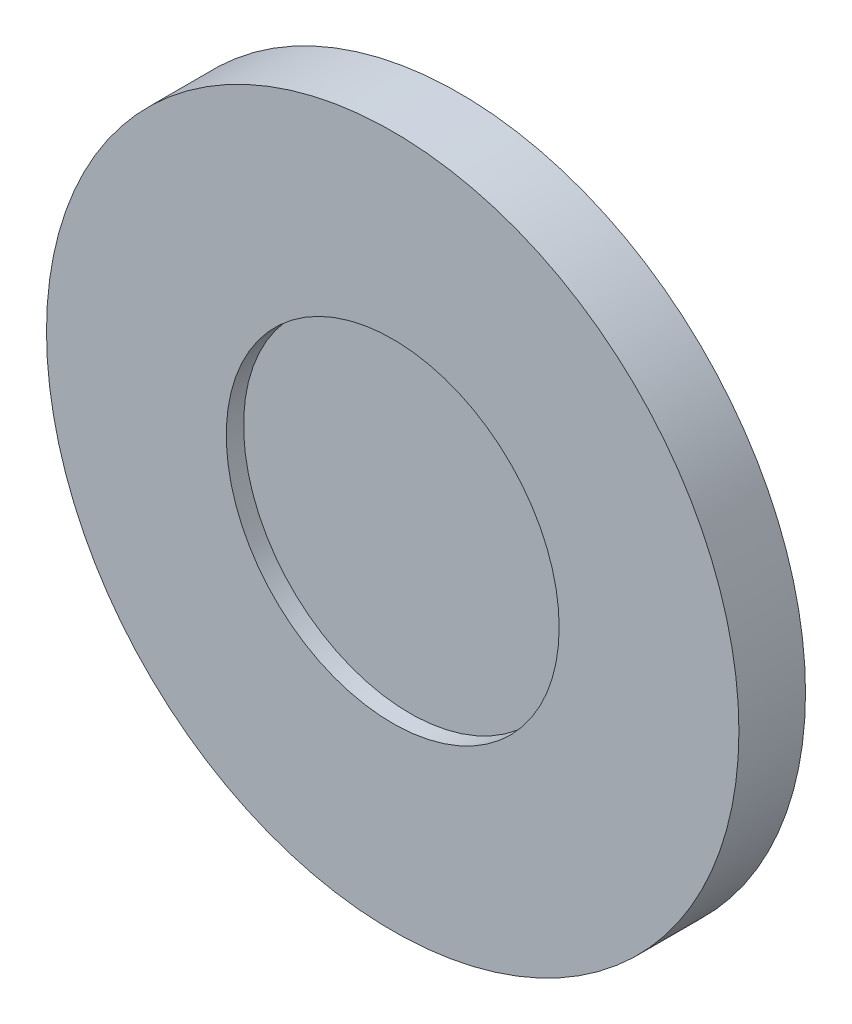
ISO-10303-21;
HEADER;
FILE_DESCRIPTION(('STEP AP214'),'2;1');
FILE_NAME('part.step','',(''),(''),'','','');
FILE_SCHEMA(('AUTOMOTIVE_DESIGN { 1 0 10303 214 1 1 1 1 }'));
ENDSEC;
DATA;
#1=APPLICATION_CONTEXT('core data for automotive mechanical design processes');
#2=APPLICATION_PROTOCOL_DEFINITION('international standard','automotive_design',2000,#1);
#3=PRODUCT_CONTEXT('',#1,'mechanical');
#4=PRODUCT('Part','Part','',(#3));
#5=PRODUCT_RELATED_PRODUCT_CATEGORY('part','',(#4));
#6=PRODUCT_DEFINITION_FORMATION('','',#4);
#7=PRODUCT_DEFINITION_CONTEXT('part definition',#1,'design');
#8=PRODUCT_DEFINITION('design','',#6,#7);
#9=PRODUCT_DEFINITION_SHAPE('','',#8);
#10=(LENGTH_UNIT() NAMED_UNIT(*) SI_UNIT(.MILLI.,.METRE.));
#11=(NAMED_UNIT(*) PLANE_ANGLE_UNIT() SI_UNIT($,.RADIAN.));
#12=(NAMED_UNIT(*) SI_UNIT($,.STERADIAN.) SOLID_ANGLE_UNIT());
#13=UNCERTAINTY_MEASURE_WITH_UNIT(LENGTH_MEASURE(1.E-05),#10,'distance_accuracy_value','');
#14=(GEOMETRIC_REPRESENTATION_CONTEXT(3) GLOBAL_UNCERTAINTY_ASSIGNED_CONTEXT((#13)) GLOBAL_UNIT_ASSIGNED_CONTEXT((#10,
#11,#12)) REPRESENTATION_CONTEXT('',''));
#15=CARTESIAN_POINT('',(0.,0.,0.));
#16=DIRECTION('',(0.,0.,1.));
#17=DIRECTION('',(1.,0.,0.));
#18=AXIS2_PLACEMENT_3D('',#15,#16,#17);
#19=CARTESIAN_POINT('',(0.,0.,0.));
#20=DIRECTION('',(0.,0.,1.));
#21=DIRECTION('',(1.,0.,0.));
#22=AXIS2_PLACEMENT_3D('',#19,#20,#21);
#23=PLANE('',#22);
#24=DIRECTION('',(-0.390731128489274,-0.92050485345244,0.));
#25=VECTOR('',#24,1.);
#26=CARTESIAN_POINT('',(-15.2385140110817,-35.8996892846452,0.));
#27=LINE('',#26,#25);
#28=CARTESIAN_POINT('',(-15.2385140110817,-35.8996892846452,0.));
#29=VERTEX_POINT('',#28);
#30=CARTESIAN_POINT('',(-18.1689974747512,-42.8034756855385,0.));
#31=VERTEX_POINT('',#30);
#32=EDGE_CURVE('E872',#29,#31,#27,.T.);
#33=ORIENTED_EDGE('',*,*,#32,.T.);
#34=CARTESIAN_POINT('',(0.,0.,0.));
#35=DIRECTION('',(0.,0.,1.));
#36=DIRECTION('',(1.,0.,0.));
#37=AXIS2_PLACEMENT_3D('',#34,#35,#36);
#38=CIRCLE('',#37,46.5);
#39=CARTESIAN_POINT('',(18.1689974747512,-42.8034756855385,0.));
#40=VERTEX_POINT('',#39);
#41=EDGE_CURVE('E864',#31,#40,#38,.T.);
#42=ORIENTED_EDGE('',*,*,#41,.T.);
#43=DIRECTION('',(-0.390731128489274,0.92050485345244,0.));
#44=VECTOR('',#43,1.);
#45=CARTESIAN_POINT('',(18.1689974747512,-42.8034756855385,0.));
#46=LINE('',#45,#44);
#47=CARTESIAN_POINT('',(15.2385140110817,-35.8996892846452,0.));
#48=VERTEX_POINT('',#47);
#49=EDGE_CURVE('E884',#40,#48,#46,.T.);
#50=ORIENTED_EDGE('',*,*,#49,.T.);
#51=CARTESIAN_POINT('',(0.,0.,0.));
#52=DIRECTION('',(0.,0.,-1.));
#53=DIRECTION('',(-1.,0.,0.));
#54=AXIS2_PLACEMENT_3D('',#51,#52,#53);
#55=CIRCLE('',#54,39.);
#56=EDGE_CURVE('E887',#48,#29,#55,.T.);
#57=ORIENTED_EDGE('',*,*,#56,.T.);
#58=EDGE_LOOP('',(#33,#42,#50,#57));
#59=FACE_BOUND('',#58,.T.);
#60=DIRECTION('',(-0.601815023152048,0.798635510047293,0.));
#61=VECTOR('',#60,1.);
#62=CARTESIAN_POINT('',(-23.4707859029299,31.1467848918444,0.));
#63=LINE('',#62,#61);
#64=CARTESIAN_POINT('',(-23.4707859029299,31.1467848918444,0.));
#65=VERTEX_POINT('',#64);
#66=CARTESIAN_POINT('',(-27.9843985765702,37.1365512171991,0.));
#67=VERTEX_POINT('',#66);
#68=EDGE_CURVE('E905',#65,#67,#63,.T.);
#69=ORIENTED_EDGE('',*,*,#68,.T.);
#70=CARTESIAN_POINT('',(0.,0.,0.));
#71=DIRECTION('',(0.,0.,1.));
#72=DIRECTION('',(1.,0.,0.));
#73=AXIS2_PLACEMENT_3D('',#70,#71,#72);
#74=CIRCLE('',#73,46.5);
#75=CARTESIAN_POINT('',(-46.1533960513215,5.66692446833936,0.));
#76=VERTEX_POINT('',#75);
#77=EDGE_CURVE('E894',#67,#76,#74,.T.);
#78=ORIENTED_EDGE('',*,*,#77,.T.);
#79=DIRECTION('',(0.992546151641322,-0.121869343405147,0.));
#80=VECTOR('',#79,1.);
#81=CARTESIAN_POINT('',(-46.1533960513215,5.66692446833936,0.));
#82=LINE('',#81,#80);
#83=CARTESIAN_POINT('',(-38.7092999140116,4.75290439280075,0.));
#84=VERTEX_POINT('',#83);
#85=EDGE_CURVE('E917',#76,#84,#82,.T.);
#86=ORIENTED_EDGE('',*,*,#85,.T.);
#87=CARTESIAN_POINT('',(0.,0.,0.));
#88=DIRECTION('',(0.,0.,-1.));
#89=DIRECTION('',(-1.,0.,0.));
#90=AXIS2_PLACEMENT_3D('',#87,#88,#89);
#91=CIRCLE('',#90,39.);
#92=EDGE_CURVE('E920',#84,#65,#91,.T.);
#93=ORIENTED_EDGE('',*,*,#92,.T.);
#94=EDGE_LOOP('',(#69,#78,#86,#93));
#95=FACE_BOUND('',#94,.T.);
#96=DIRECTION('',(0.992546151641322,0.121869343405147,0.));
#97=VECTOR('',#96,1.);
#98=CARTESIAN_POINT('',(38.7092999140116,4.75290439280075,0.));
#99=LINE('',#98,#97);
#100=CARTESIAN_POINT('',(38.7092999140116,4.75290439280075,0.));
#101=VERTEX_POINT('',#100);
#102=CARTESIAN_POINT('',(46.1533960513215,5.66692446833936,0.));
#103=VERTEX_POINT('',#102);
#104=EDGE_CURVE('E938',#101,#103,#99,.T.);
#105=ORIENTED_EDGE('',*,*,#104,.T.);
#106=CARTESIAN_POINT('',(0.,0.,0.));
#107=DIRECTION('',(0.,0.,1.));
#108=DIRECTION('',(1.,0.,0.));
#109=AXIS2_PLACEMENT_3D('',#106,#107,#108);
#110=CIRCLE('',#109,46.5);
#111=CARTESIAN_POINT('',(27.9843985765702,37.1365512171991,0.));
#112=VERTEX_POINT('',#111);
#113=EDGE_CURVE('E927',#103,#112,#110,.T.);
#114=ORIENTED_EDGE('',*,*,#113,.T.);
#115=DIRECTION('',(-0.601815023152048,-0.798635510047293,0.));
#116=VECTOR('',#115,1.);
#117=CARTESIAN_POINT('',(27.9843985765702,37.1365512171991,0.));
#118=LINE('',#117,#116);
#119=CARTESIAN_POINT('',(23.4707859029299,31.1467848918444,0.));
#120=VERTEX_POINT('',#119);
#121=EDGE_CURVE('E950',#112,#120,#118,.T.);
#122=ORIENTED_EDGE('',*,*,#121,.T.);
#123=CARTESIAN_POINT('',(0.,0.,0.));
#124=DIRECTION('',(0.,0.,-1.));
#125=DIRECTION('',(-1.,0.,0.));
#126=AXIS2_PLACEMENT_3D('',#123,#124,#125);
#127=CIRCLE('',#126,39.);
#128=EDGE_CURVE('E953',#120,#101,#127,.T.);
#129=ORIENTED_EDGE('',*,*,#128,.T.);
#130=EDGE_LOOP('',(#105,#114,#122,#129));
#131=FACE_BOUND('',#130,.T.);
#132=CARTESIAN_POINT('',(0.,0.,0.));
#133=DIRECTION('',(0.,0.,1.));
#134=DIRECTION('',(1.,0.,0.));
#135=AXIS2_PLACEMENT_3D('',#132,#133,#134);
#136=CIRCLE('',#135,52.);
#137=CARTESIAN_POINT('',(52.,0.,0.));
#138=VERTEX_POINT('',#137);
#139=EDGE_CURVE('E960',#138,#138,#136,.T.);
#140=ORIENTED_EDGE('',*,*,#139,.F.);
#141=EDGE_LOOP('',(#140));
#142=FACE_BOUND('',#141,.T.);
#143=DIRECTION('',(0.,-1.,0.));
#144=VECTOR('',#143,1.);
#145=CARTESIAN_POINT('',(-0.349999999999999,15.25,0.));
#146=LINE('',#145,#144);
#147=CARTESIAN_POINT('',(-0.349999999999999,8.7689011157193,0.));
#148=VERTEX_POINT('',#147);
#149=CARTESIAN_POINT('',(-0.349999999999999,8.75,0.));
#150=VERTEX_POINT('',#149);
#151=EDGE_CURVE('E748',#148,#150,#146,.T.);
#152=ORIENTED_EDGE('',*,*,#151,.T.);
#153=DIRECTION('',(1.,0.,0.));
#154=VECTOR('',#153,1.);
#155=CARTESIAN_POINT('',(-0.349999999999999,8.75,0.));
#156=LINE('',#155,#154);
#157=CARTESIAN_POINT('',(0.350000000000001,8.75,0.));
#158=VERTEX_POINT('',#157);
#159=EDGE_CURVE('E747',#150,#158,#156,.T.);
#160=ORIENTED_EDGE('',*,*,#159,.T.);
#161=DIRECTION('',(0.,1.,0.));
#162=VECTOR('',#161,1.);
#163=CARTESIAN_POINT('',(0.350000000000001,8.75,0.));
#164=LINE('',#163,#162);
#165=CARTESIAN_POINT('',(0.350000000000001,8.7689011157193,0.));
#166=VERTEX_POINT('',#165);
#167=EDGE_CURVE('E752',#158,#166,#164,.T.);
#168=ORIENTED_EDGE('',*,*,#167,.T.);
#169=CARTESIAN_POINT('',(0.,12.,0.));
#170=DIRECTION('',(0.,0.,1.));
#171=DIRECTION('',(1.,0.,0.));
#172=AXIS2_PLACEMENT_3D('',#169,#170,#171);
#173=CIRCLE('',#172,3.25);
#174=CARTESIAN_POINT('',(3.2310988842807,11.65,0.));
#175=VERTEX_POINT('',#174);
#176=EDGE_CURVE('E849',#166,#175,#173,.T.);
#177=ORIENTED_EDGE('',*,*,#176,.T.);
#178=DIRECTION('',(1.,0.,0.));
#179=VECTOR('',#178,1.);
#180=CARTESIAN_POINT('',(-3.25,11.65,0.));
#181=LINE('',#180,#179);
#182=CARTESIAN_POINT('',(3.25,11.65,0.));
#183=VERTEX_POINT('',#182);
#184=EDGE_CURVE('E817',#175,#183,#181,.T.);
#185=ORIENTED_EDGE('',*,*,#184,.T.);
#186=DIRECTION('',(0.,1.,0.));
#187=VECTOR('',#186,1.);
#188=CARTESIAN_POINT('',(3.25,11.65,0.));
#189=LINE('',#188,#187);
#190=CARTESIAN_POINT('',(3.25,12.35,0.));
#191=VERTEX_POINT('',#190);
#192=EDGE_CURVE('E821',#183,#191,#189,.T.);
#193=ORIENTED_EDGE('',*,*,#192,.T.);
#194=DIRECTION('',(-1.,0.,0.));
#195=VECTOR('',#194,1.);
#196=CARTESIAN_POINT('',(3.25,12.35,0.));
#197=LINE('',#196,#195);
#198=CARTESIAN_POINT('',(3.2310988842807,12.35,0.));
#199=VERTEX_POINT('',#198);
#200=EDGE_CURVE('E804',#191,#199,#197,.T.);
#201=ORIENTED_EDGE('',*,*,#200,.T.);
#202=CARTESIAN_POINT('',(0.350000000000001,15.2310988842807,0.));
#203=VERTEX_POINT('',#202);
#204=EDGE_CURVE('E860',#199,#203,#173,.T.);
#205=ORIENTED_EDGE('',*,*,#204,.T.);
#206=CARTESIAN_POINT('',(0.350000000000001,15.25,0.));
#207=VERTEX_POINT('',#206);
#208=EDGE_CURVE('E751',#203,#207,#164,.T.);
#209=ORIENTED_EDGE('',*,*,#208,.T.);
#210=DIRECTION('',(-1.,0.,0.));
#211=VECTOR('',#210,1.);
#212=CARTESIAN_POINT('',(0.350000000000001,15.25,0.));
#213=LINE('',#212,#211);
#214=CARTESIAN_POINT('',(-0.349999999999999,15.25,0.));
#215=VERTEX_POINT('',#214);
#216=EDGE_CURVE('E755',#207,#215,#213,.T.);
#217=ORIENTED_EDGE('',*,*,#216,.T.);
#218=CARTESIAN_POINT('',(-0.349999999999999,15.2310988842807,0.));
#219=VERTEX_POINT('',#218);
#220=EDGE_CURVE('E744',#215,#219,#146,.T.);
#221=ORIENTED_EDGE('',*,*,#220,.T.);
#222=CARTESIAN_POINT('',(-3.2310988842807,12.35,0.));
#223=VERTEX_POINT('',#222);
#224=EDGE_CURVE('E859',#219,#223,#173,.T.);
#225=ORIENTED_EDGE('',*,*,#224,.T.);
#226=CARTESIAN_POINT('',(-3.25,12.35,0.));
#227=VERTEX_POINT('',#226);
#228=EDGE_CURVE('E824',#223,#227,#197,.T.);
#229=ORIENTED_EDGE('',*,*,#228,.T.);
#230=DIRECTION('',(0.,-1.,0.));
#231=VECTOR('',#230,1.);
#232=CARTESIAN_POINT('',(-3.25,12.35,0.));
#233=LINE('',#232,#231);
#234=CARTESIAN_POINT('',(-3.25,11.65,0.));
#235=VERTEX_POINT('',#234);
#236=EDGE_CURVE('E799',#227,#235,#233,.T.);
#237=ORIENTED_EDGE('',*,*,#236,.T.);
#238=CARTESIAN_POINT('',(-3.2310988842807,11.65,0.));
#239=VERTEX_POINT('',#238);
#240=EDGE_CURVE('E818',#235,#239,#181,.T.);
#241=ORIENTED_EDGE('',*,*,#240,.T.);
#242=EDGE_CURVE('E856',#239,#148,#173,.T.);
#243=ORIENTED_EDGE('',*,*,#242,.T.);
#244=EDGE_LOOP('',(#152,#160,#168,#177,#185,#193,#201,#205,#209,#217,#221,#225,#229,#237,#241,#243));
#245=FACE_BOUND('',#244,.T.);
#246=DIRECTION('',(0.,-1.,0.));
#247=VECTOR('',#246,1.);
#248=CARTESIAN_POINT('',(-10.7423048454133,-2.75,0.));
#249=LINE('',#248,#247);
#250=CARTESIAN_POINT('',(-10.7423048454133,-9.2310988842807,0.));
#251=VERTEX_POINT('',#250);
#252=CARTESIAN_POINT('',(-10.7423048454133,-9.25,0.));
#253=VERTEX_POINT('',#252);
#254=EDGE_CURVE('E620',#251,#253,#249,.T.);
#255=ORIENTED_EDGE('',*,*,#254,.T.);
#256=DIRECTION('',(1.,0.,0.));
#257=VECTOR('',#256,1.);
#258=CARTESIAN_POINT('',(-10.7423048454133,-9.25,0.));
#259=LINE('',#258,#257);
#260=CARTESIAN_POINT('',(-10.0423048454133,-9.25,0.));
#261=VERTEX_POINT('',#260);
#262=EDGE_CURVE('E619',#253,#261,#259,.T.);
#263=ORIENTED_EDGE('',*,*,#262,.T.);
#264=DIRECTION('',(0.,1.,0.));
#265=VECTOR('',#264,1.);
#266=CARTESIAN_POINT('',(-10.0423048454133,-9.25,0.));
#267=LINE('',#266,#265);
#268=CARTESIAN_POINT('',(-10.0423048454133,-9.2310988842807,0.));
#269=VERTEX_POINT('',#268);
#270=EDGE_CURVE('E624',#261,#269,#267,.T.);
#271=ORIENTED_EDGE('',*,*,#270,.T.);
#272=CARTESIAN_POINT('',(-10.3923048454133,-6.,0.));
#273=DIRECTION('',(0.,0.,1.));
#274=DIRECTION('',(1.,0.,0.));
#275=AXIS2_PLACEMENT_3D('',#272,#273,#274);
#276=CIRCLE('',#275,3.25);
#277=CARTESIAN_POINT('',(-7.16120596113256,-6.35,0.));
#278=VERTEX_POINT('',#277);
#279=EDGE_CURVE('E721',#269,#278,#276,.T.);
#280=ORIENTED_EDGE('',*,*,#279,.T.);
#281=DIRECTION('',(1.,0.,0.));
#282=VECTOR('',#281,1.);
#283=CARTESIAN_POINT('',(-13.6423048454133,-6.35,0.));
#284=LINE('',#283,#282);
#285=CARTESIAN_POINT('',(-7.14230484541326,-6.35,0.));
#286=VERTEX_POINT('',#285);
#287=EDGE_CURVE('E689',#278,#286,#284,.T.);
#288=ORIENTED_EDGE('',*,*,#287,.T.);
#289=DIRECTION('',(0.,1.,0.));
#290=VECTOR('',#289,1.);
#291=CARTESIAN_POINT('',(-7.14230484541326,-6.35,0.));
#292=LINE('',#291,#290);
#293=CARTESIAN_POINT('',(-7.14230484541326,-5.65,0.));
#294=VERTEX_POINT('',#293);
#295=EDGE_CURVE('E693',#286,#294,#292,.T.);
#296=ORIENTED_EDGE('',*,*,#295,.T.);
#297=DIRECTION('',(-1.,0.,0.));
#298=VECTOR('',#297,1.);
#299=CARTESIAN_POINT('',(-7.14230484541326,-5.65,0.));
#300=LINE('',#299,#298);
#301=CARTESIAN_POINT('',(-7.16120596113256,-5.65,0.));
#302=VERTEX_POINT('',#301);
#303=EDGE_CURVE('E676',#294,#302,#300,.T.);
#304=ORIENTED_EDGE('',*,*,#303,.T.);
#305=CARTESIAN_POINT('',(-10.0423048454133,-2.7689011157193,0.));
#306=VERTEX_POINT('',#305);
#307=EDGE_CURVE('E732',#302,#306,#276,.T.);
#308=ORIENTED_EDGE('',*,*,#307,.T.);
#309=CARTESIAN_POINT('',(-10.0423048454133,-2.75,0.));
#310=VERTEX_POINT('',#309);
#311=EDGE_CURVE('E623',#306,#310,#267,.T.);
#312=ORIENTED_EDGE('',*,*,#311,.T.);
#313=DIRECTION('',(-1.,0.,0.));
#314=VECTOR('',#313,1.);
#315=CARTESIAN_POINT('',(-10.0423048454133,-2.75,0.));
#316=LINE('',#315,#314);
#317=CARTESIAN_POINT('',(-10.7423048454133,-2.75,0.));
#318=VERTEX_POINT('',#317);
#319=EDGE_CURVE('E627',#310,#318,#316,.T.);
#320=ORIENTED_EDGE('',*,*,#319,.T.);
#321=CARTESIAN_POINT('',(-10.7423048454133,-2.7689011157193,0.));
#322=VERTEX_POINT('',#321);
#323=EDGE_CURVE('E616',#318,#322,#249,.T.);
#324=ORIENTED_EDGE('',*,*,#323,.T.);
#325=CARTESIAN_POINT('',(-13.623403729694,-5.65,0.));
#326=VERTEX_POINT('',#325);
#327=EDGE_CURVE('E731',#322,#326,#276,.T.);
#328=ORIENTED_EDGE('',*,*,#327,.T.);
#329=CARTESIAN_POINT('',(-13.6423048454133,-5.65,0.));
#330=VERTEX_POINT('',#329);
#331=EDGE_CURVE('E696',#326,#330,#300,.T.);
#332=ORIENTED_EDGE('',*,*,#331,.T.);
#333=DIRECTION('',(0.,-1.,0.));
#334=VECTOR('',#333,1.);
#335=CARTESIAN_POINT('',(-13.6423048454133,-5.65,0.));
#336=LINE('',#335,#334);
#337=CARTESIAN_POINT('',(-13.6423048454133,-6.35,0.));
#338=VERTEX_POINT('',#337);
#339=EDGE_CURVE('E671',#330,#338,#336,.T.);
#340=ORIENTED_EDGE('',*,*,#339,.T.);
#341=CARTESIAN_POINT('',(-13.623403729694,-6.35,0.));
#342=VERTEX_POINT('',#341);
#343=EDGE_CURVE('E690',#338,#342,#284,.T.);
#344=ORIENTED_EDGE('',*,*,#343,.T.);
#345=EDGE_CURVE('E728',#342,#251,#276,.T.);
#346=ORIENTED_EDGE('',*,*,#345,.T.);
#347=EDGE_LOOP('',(#255,#263,#271,#280,#288,#296,#304,#308,#312,#320,#324,#328,#332,#340,#344,#346));
#348=FACE_BOUND('',#347,.T.);
#349=DIRECTION('',(0.,-1.,0.));
#350=VECTOR('',#349,1.);
#351=CARTESIAN_POINT('',(10.0423048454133,-2.75000000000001,0.));
#352=LINE('',#351,#350);
#353=CARTESIAN_POINT('',(10.0423048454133,-9.23109888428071,0.));
#354=VERTEX_POINT('',#353);
#355=CARTESIAN_POINT('',(10.0423048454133,-9.25000000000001,0.));
#356=VERTEX_POINT('',#355);
#357=EDGE_CURVE('E2091',#354,#356,#352,.T.);
#358=ORIENTED_EDGE('',*,*,#357,.T.);
#359=DIRECTION('',(1.,0.,0.));
#360=VECTOR('',#359,1.);
#361=CARTESIAN_POINT('',(10.0423048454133,-9.25000000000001,0.));
#362=LINE('',#361,#360);
#363=CARTESIAN_POINT('',(10.7423048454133,-9.25000000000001,0.));
#364=VERTEX_POINT('',#363);
#365=EDGE_CURVE('E507',#356,#364,#362,.T.);
#366=ORIENTED_EDGE('',*,*,#365,.T.);
#367=DIRECTION('',(0.,1.,0.));
#368=VECTOR('',#367,1.);
#369=CARTESIAN_POINT('',(10.7423048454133,-9.25000000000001,0.));
#370=LINE('',#369,#368);
#371=CARTESIAN_POINT('',(10.7423048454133,-9.23109888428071,0.));
#372=VERTEX_POINT('',#371);
#373=EDGE_CURVE('E1023',#364,#372,#370,.T.);
#374=ORIENTED_EDGE('',*,*,#373,.T.);
#375=CARTESIAN_POINT('',(10.3923048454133,-6.00000000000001,0.));
#376=DIRECTION('',(0.,0.,1.));
#377=DIRECTION('',(1.,0.,0.));
#378=AXIS2_PLACEMENT_3D('',#375,#376,#377);
#379=CIRCLE('',#378,3.25);
#380=CARTESIAN_POINT('',(13.623403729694,-6.35,0.));
#381=VERTEX_POINT('',#380);
#382=EDGE_CURVE('E593',#372,#381,#379,.T.);
#383=ORIENTED_EDGE('',*,*,#382,.T.);
#384=DIRECTION('',(1.,0.,0.));
#385=VECTOR('',#384,1.);
#386=CARTESIAN_POINT('',(7.14230484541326,-6.35,0.));
#387=LINE('',#386,#385);
#388=CARTESIAN_POINT('',(13.6423048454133,-6.35,0.));
#389=VERTEX_POINT('',#388);
#390=EDGE_CURVE('E561',#381,#389,#387,.T.);
#391=ORIENTED_EDGE('',*,*,#390,.T.);
#392=DIRECTION('',(0.,1.,0.));
#393=VECTOR('',#392,1.);
#394=CARTESIAN_POINT('',(13.6423048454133,-6.35,0.));
#395=LINE('',#394,#393);
#396=CARTESIAN_POINT('',(13.6423048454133,-5.65000000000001,0.));
#397=VERTEX_POINT('',#396);
#398=EDGE_CURVE('E565',#389,#397,#395,.T.);
#399=ORIENTED_EDGE('',*,*,#398,.T.);
#400=DIRECTION('',(-1.,0.,0.));
#401=VECTOR('',#400,1.);
#402=CARTESIAN_POINT('',(13.6423048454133,-5.65000000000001,0.));
#403=LINE('',#402,#401);
#404=CARTESIAN_POINT('',(13.623403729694,-5.65000000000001,0.));
#405=VERTEX_POINT('',#404);
#406=EDGE_CURVE('E549',#397,#405,#403,.T.);
#407=ORIENTED_EDGE('',*,*,#406,.T.);
#408=CARTESIAN_POINT('',(10.7423048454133,-2.7689011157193,0.));
#409=VERTEX_POINT('',#408);
#410=EDGE_CURVE('E604',#405,#409,#379,.T.);
#411=ORIENTED_EDGE('',*,*,#410,.T.);
#412=CARTESIAN_POINT('',(10.7423048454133,-2.75000000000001,0.));
#413=VERTEX_POINT('',#412);
#414=EDGE_CURVE('E2099',#409,#413,#370,.T.);
#415=ORIENTED_EDGE('',*,*,#414,.T.);
#416=DIRECTION('',(-1.,0.,0.));
#417=VECTOR('',#416,1.);
#418=CARTESIAN_POINT('',(10.7423048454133,-2.75000000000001,0.));
#419=LINE('',#418,#417);
#420=CARTESIAN_POINT('',(10.0423048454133,-2.75000000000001,0.));
#421=VERTEX_POINT('',#420);
#422=EDGE_CURVE('E495',#413,#421,#419,.T.);
#423=ORIENTED_EDGE('',*,*,#422,.T.);
#424=CARTESIAN_POINT('',(10.0423048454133,-2.7689011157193,0.));
#425=VERTEX_POINT('',#424);
#426=EDGE_CURVE('E2092',#421,#425,#352,.T.);
#427=ORIENTED_EDGE('',*,*,#426,.T.);
#428=CARTESIAN_POINT('',(7.16120596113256,-5.65000000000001,0.));
#429=VERTEX_POINT('',#428);
#430=EDGE_CURVE('E603',#425,#429,#379,.T.);
#431=ORIENTED_EDGE('',*,*,#430,.T.);
#432=CARTESIAN_POINT('',(7.14230484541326,-5.65000000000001,0.));
#433=VERTEX_POINT('',#432);
#434=EDGE_CURVE('E568',#429,#433,#403,.T.);
#435=ORIENTED_EDGE('',*,*,#434,.T.);
#436=DIRECTION('',(0.,-1.,0.));
#437=VECTOR('',#436,1.);
#438=CARTESIAN_POINT('',(7.14230484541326,-5.65000000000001,0.));
#439=LINE('',#438,#437);
#440=CARTESIAN_POINT('',(7.14230484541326,-6.35,0.));
#441=VERTEX_POINT('',#440);
#442=EDGE_CURVE('E544',#433,#441,#439,.T.);
#443=ORIENTED_EDGE('',*,*,#442,.T.);
#444=CARTESIAN_POINT('',(7.16120596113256,-6.35,0.));
#445=VERTEX_POINT('',#444);
#446=EDGE_CURVE('E562',#441,#445,#387,.T.);
#447=ORIENTED_EDGE('',*,*,#446,.T.);
#448=EDGE_CURVE('E600',#445,#354,#379,.T.);
#449=ORIENTED_EDGE('',*,*,#448,.T.);
#450=EDGE_LOOP('',(#358,#366,#374,#383,#391,#399,#407,#411,#415,#423,#427,#431,#435,#443,#447,#449));
#451=FACE_BOUND('',#450,.T.);
#452=ADVANCED_FACE('F39',(#59,#95,#131,#142,#245,#348,#451),#23,.F.);
#453=CARTESIAN_POINT('',(10.3923048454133,-6.00000000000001,0.3));
#454=DIRECTION('',(0.,0.,-1.));
#455=DIRECTION('',(-1.,0.,0.));
#456=AXIS2_PLACEMENT_3D('',#453,#454,#455);
#457=CYLINDRICAL_SURFACE('',#456,3.25);
#458=CARTESIAN_POINT('',(10.3923048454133,-6.00000000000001,0.3));
#459=DIRECTION('',(0.,0.,1.));
#460=DIRECTION('',(1.,0.,0.));
#461=AXIS2_PLACEMENT_3D('',#458,#459,#460);
#462=CIRCLE('',#461,3.25);
#463=CARTESIAN_POINT('',(7.16120596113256,-6.35,0.3));
#464=VERTEX_POINT('',#463);
#465=CARTESIAN_POINT('',(10.0423048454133,-9.23109888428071,0.3));
#466=VERTEX_POINT('',#465);
#467=EDGE_CURVE('E594',#464,#466,#462,.T.);
#468=ORIENTED_EDGE('',*,*,#467,.T.);
#469=DIRECTION('',(0.,0.,-1.));
#470=VECTOR('',#469,1.);
#471=CARTESIAN_POINT('',(10.0423048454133,-9.23109888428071,0.3));
#472=LINE('',#471,#470);
#473=EDGE_CURVE('E541',#466,#354,#472,.T.);
#474=ORIENTED_EDGE('',*,*,#473,.T.);
#475=ORIENTED_EDGE('',*,*,#448,.F.);
#476=DIRECTION('',(0.,0.,-1.));
#477=VECTOR('',#476,1.);
#478=CARTESIAN_POINT('',(7.16120596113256,-6.35,0.3));
#479=LINE('',#478,#477);
#480=EDGE_CURVE('E587',#445,#464,#479,.F.);
#481=ORIENTED_EDGE('',*,*,#480,.T.);
#482=EDGE_LOOP('',(#468,#474,#475,#481));
#483=FACE_BOUND('',#482,.T.);
#484=ADVANCED_FACE('F1031',(#483),#457,.F.);
#485=ORIENTED_EDGE('',*,*,#382,.F.);
#486=DIRECTION('',(0.,0.,-1.));
#487=VECTOR('',#486,1.);
#488=CARTESIAN_POINT('',(10.7423048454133,-9.23109888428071,0.3));
#489=LINE('',#488,#487);
#490=CARTESIAN_POINT('',(10.7423048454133,-9.23109888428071,0.3));
#491=VERTEX_POINT('',#490);
#492=EDGE_CURVE('E527',#372,#491,#489,.F.);
#493=ORIENTED_EDGE('',*,*,#492,.T.);
#494=CARTESIAN_POINT('',(13.623403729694,-6.35,0.3));
#495=VERTEX_POINT('',#494);
#496=EDGE_CURVE('E598',#491,#495,#462,.T.);
#497=ORIENTED_EDGE('',*,*,#496,.T.);
#498=DIRECTION('',(0.,0.,-1.));
#499=VECTOR('',#498,1.);
#500=CARTESIAN_POINT('',(13.623403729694,-6.35,0.3));
#501=LINE('',#500,#499);
#502=EDGE_CURVE('E590',#495,#381,#501,.T.);
#503=ORIENTED_EDGE('',*,*,#502,.T.);
#504=EDGE_LOOP('',(#485,#493,#497,#503));
#505=FACE_BOUND('',#504,.T.);
#506=ADVANCED_FACE('F1028',(#505),#457,.F.);
#507=ORIENTED_EDGE('',*,*,#430,.F.);
#508=DIRECTION('',(0.,0.,-1.));
#509=VECTOR('',#508,1.);
#510=CARTESIAN_POINT('',(10.0423048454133,-2.7689011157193,0.3));
#511=LINE('',#510,#509);
#512=CARTESIAN_POINT('',(10.0423048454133,-2.7689011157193,0.3));
#513=VERTEX_POINT('',#512);
#514=EDGE_CURVE('E535',#425,#513,#511,.F.);
#515=ORIENTED_EDGE('',*,*,#514,.T.);
#516=CARTESIAN_POINT('',(7.16120596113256,-5.65000000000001,0.3));
#517=VERTEX_POINT('',#516);
#518=EDGE_CURVE('E597',#513,#517,#462,.T.);
#519=ORIENTED_EDGE('',*,*,#518,.T.);
#520=DIRECTION('',(0.,0.,-1.));
#521=VECTOR('',#520,1.);
#522=CARTESIAN_POINT('',(7.16120596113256,-5.65000000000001,0.3));
#523=LINE('',#522,#521);
#524=EDGE_CURVE('E584',#517,#429,#523,.T.);
#525=ORIENTED_EDGE('',*,*,#524,.T.);
#526=EDGE_LOOP('',(#507,#515,#519,#525));
#527=FACE_BOUND('',#526,.T.);
#528=ADVANCED_FACE('F1030',(#527),#457,.F.);
#529=CARTESIAN_POINT('',(13.623403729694,-5.65000000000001,0.3));
#530=VERTEX_POINT('',#529);
#531=CARTESIAN_POINT('',(10.7423048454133,-2.7689011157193,0.3));
#532=VERTEX_POINT('',#531);
#533=EDGE_CURVE('E599',#530,#532,#462,.T.);
#534=ORIENTED_EDGE('',*,*,#533,.T.);
#535=DIRECTION('',(0.,0.,-1.));
#536=VECTOR('',#535,1.);
#537=CARTESIAN_POINT('',(10.7423048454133,-2.7689011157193,0.3));
#538=LINE('',#537,#536);
#539=EDGE_CURVE('E519',#532,#409,#538,.T.);
#540=ORIENTED_EDGE('',*,*,#539,.T.);
#541=ORIENTED_EDGE('',*,*,#410,.F.);
#542=DIRECTION('',(0.,0.,-1.));
#543=VECTOR('',#542,1.);
#544=CARTESIAN_POINT('',(13.623403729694,-5.65000000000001,0.3));
#545=LINE('',#544,#543);
#546=EDGE_CURVE('E581',#405,#530,#545,.F.);
#547=ORIENTED_EDGE('',*,*,#546,.T.);
#548=EDGE_LOOP('',(#534,#540,#541,#547));
#549=FACE_BOUND('',#548,.T.);
#550=ADVANCED_FACE('F1003',(#549),#457,.F.);
#551=CARTESIAN_POINT('',(10.3923048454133,-6.00000000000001,0.3));
#552=DIRECTION('',(0.,0.,1.));
#553=DIRECTION('',(1.,0.,0.));
#554=AXIS2_PLACEMENT_3D('',#551,#552,#553);
#555=PLANE('',#554);
#556=DIRECTION('',(0.,1.,0.));
#557=VECTOR('',#556,1.);
#558=CARTESIAN_POINT('',(10.0423048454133,-6.00000000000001,0.3));
#559=LINE('',#558,#557);
#560=CARTESIAN_POINT('',(10.0423048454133,-6.35,0.3));
#561=VERTEX_POINT('',#560);
#562=EDGE_CURVE('E539',#466,#561,#559,.T.);
#563=ORIENTED_EDGE('',*,*,#562,.F.);
#564=ORIENTED_EDGE('',*,*,#467,.F.);
#565=DIRECTION('',(-1.,0.,0.));
#566=VECTOR('',#565,1.);
#567=CARTESIAN_POINT('',(10.3923048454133,-6.35,0.3));
#568=LINE('',#567,#566);
#569=EDGE_CURVE('E47',#561,#464,#568,.T.);
#570=ORIENTED_EDGE('',*,*,#569,.F.);
#571=EDGE_LOOP('',(#563,#564,#570));
#572=FACE_BOUND('',#571,.T.);
#573=ADVANCED_FACE('F1423',(#572),#555,.F.);
#574=DIRECTION('',(0.,-1.,0.));
#575=VECTOR('',#574,1.);
#576=CARTESIAN_POINT('',(10.7423048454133,-6.00000000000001,0.3));
#577=LINE('',#576,#575);
#578=CARTESIAN_POINT('',(10.7423048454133,-6.35,0.3));
#579=VERTEX_POINT('',#578);
#580=EDGE_CURVE('E525',#579,#491,#577,.T.);
#581=ORIENTED_EDGE('',*,*,#580,.F.);
#582=EDGE_CURVE('E11',#495,#579,#568,.T.);
#583=ORIENTED_EDGE('',*,*,#582,.F.);
#584=ORIENTED_EDGE('',*,*,#496,.F.);
#585=EDGE_LOOP('',(#581,#583,#584));
#586=FACE_BOUND('',#585,.T.);
#587=ADVANCED_FACE('F1431',(#586),#555,.F.);
#588=DIRECTION('',(0.,1.,0.));
#589=VECTOR('',#588,1.);
#590=CARTESIAN_POINT('',(10.0423048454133,-6.00000000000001,0.3));
#591=LINE('',#590,#589);
#592=CARTESIAN_POINT('',(10.0423048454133,-5.65000000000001,0.3));
#593=VERTEX_POINT('',#592);
#594=EDGE_CURVE('E533',#593,#513,#591,.T.);
#595=ORIENTED_EDGE('',*,*,#594,.F.);
#596=DIRECTION('',(1.,0.,0.));
#597=VECTOR('',#596,1.);
#598=CARTESIAN_POINT('',(10.3923048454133,-5.65000000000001,0.3));
#599=LINE('',#598,#597);
#600=EDGE_CURVE('E988',#517,#593,#599,.T.);
#601=ORIENTED_EDGE('',*,*,#600,.F.);
#602=ORIENTED_EDGE('',*,*,#518,.F.);
#603=EDGE_LOOP('',(#595,#601,#602));
#604=FACE_BOUND('',#603,.T.);
#605=ADVANCED_FACE('F1441',(#604),#555,.F.);
#606=DIRECTION('',(0.,-1.,0.));
#607=VECTOR('',#606,1.);
#608=CARTESIAN_POINT('',(10.7423048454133,-6.00000000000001,0.3));
#609=LINE('',#608,#607);
#610=CARTESIAN_POINT('',(10.7423048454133,-5.65000000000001,0.3));
#611=VERTEX_POINT('',#610);
#612=EDGE_CURVE('E512',#532,#611,#609,.T.);
#613=ORIENTED_EDGE('',*,*,#612,.F.);
#614=ORIENTED_EDGE('',*,*,#533,.F.);
#615=EDGE_CURVE('E987',#611,#530,#599,.T.);
#616=ORIENTED_EDGE('',*,*,#615,.F.);
#617=EDGE_LOOP('',(#613,#614,#616));
#618=FACE_BOUND('',#617,.T.);
#619=ADVANCED_FACE('F1005',(#618),#555,.F.);
#620=CARTESIAN_POINT('',(7.14230484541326,-6.35,0.45));
#621=DIRECTION('',(0.,1.,0.));
#622=DIRECTION('',(0.,0.,1.));
#623=AXIS2_PLACEMENT_3D('',#620,#621,#622);
#624=PLANE('',#623);
#625=DIRECTION('',(1.,0.,0.));
#626=VECTOR('',#625,1.);
#627=CARTESIAN_POINT('',(7.14230484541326,-6.35,0.45));
#628=LINE('',#627,#626);
#629=CARTESIAN_POINT('',(7.14230484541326,-6.35,0.45));
#630=VERTEX_POINT('',#629);
#631=CARTESIAN_POINT('',(10.0423048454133,-6.35,0.45));
#632=VERTEX_POINT('',#631);
#633=EDGE_CURVE('E550',#630,#632,#628,.T.);
#634=ORIENTED_EDGE('',*,*,#633,.T.);
#635=DIRECTION('',(0.,0.,-1.));
#636=VECTOR('',#635,1.);
#637=CARTESIAN_POINT('',(10.0423048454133,-6.35,0.45));
#638=LINE('',#637,#636);
#639=EDGE_CURVE('E492',#632,#561,#638,.T.);
#640=ORIENTED_EDGE('',*,*,#639,.T.);
#641=ORIENTED_EDGE('',*,*,#569,.T.);
#642=ORIENTED_EDGE('',*,*,#480,.F.);
#643=ORIENTED_EDGE('',*,*,#446,.F.);
#644=DIRECTION('',(0.,0.,-1.));
#645=VECTOR('',#644,1.);
#646=CARTESIAN_POINT('',(7.14230484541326,-6.35,0.45));
#647=LINE('',#646,#645);
#648=EDGE_CURVE('E578',#630,#441,#647,.T.);
#649=ORIENTED_EDGE('',*,*,#648,.F.);
#650=EDGE_LOOP('',(#634,#640,#641,#642,#643,#649));
#651=FACE_BOUND('',#650,.T.);
#652=ADVANCED_FACE('F1460',(#651),#624,.T.);
#653=ORIENTED_EDGE('',*,*,#582,.T.);
#654=DIRECTION('',(0.,0.,1.));
#655=VECTOR('',#654,1.);
#656=CARTESIAN_POINT('',(10.7423048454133,-6.35,0.45));
#657=LINE('',#656,#655);
#658=CARTESIAN_POINT('',(10.7423048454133,-6.35,0.45));
#659=VERTEX_POINT('',#658);
#660=EDGE_CURVE('E522',#579,#659,#657,.T.);
#661=ORIENTED_EDGE('',*,*,#660,.T.);
#662=CARTESIAN_POINT('',(13.6423048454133,-6.35,0.45));
#663=VERTEX_POINT('',#662);
#664=EDGE_CURVE('E548',#659,#663,#628,.T.);
#665=ORIENTED_EDGE('',*,*,#664,.T.);
#666=DIRECTION('',(0.,0.,-1.));
#667=VECTOR('',#666,1.);
#668=CARTESIAN_POINT('',(13.6423048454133,-6.35,0.45));
#669=LINE('',#668,#667);
#670=EDGE_CURVE('E575',#663,#389,#669,.T.);
#671=ORIENTED_EDGE('',*,*,#670,.T.);
#672=ORIENTED_EDGE('',*,*,#390,.F.);
#673=ORIENTED_EDGE('',*,*,#502,.F.);
#674=EDGE_LOOP('',(#653,#661,#665,#671,#672,#673));
#675=FACE_BOUND('',#674,.T.);
#676=ADVANCED_FACE('F1025',(#675),#624,.T.);
#677=CARTESIAN_POINT('',(13.6423048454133,-5.65000000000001,0.45));
#678=DIRECTION('',(0.,-1.,0.));
#679=DIRECTION('',(0.,0.,-1.));
#680=AXIS2_PLACEMENT_3D('',#677,#678,#679);
#681=PLANE('',#680);
#682=ORIENTED_EDGE('',*,*,#600,.T.);
#683=DIRECTION('',(0.,0.,1.));
#684=VECTOR('',#683,1.);
#685=CARTESIAN_POINT('',(10.0423048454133,-5.65000000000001,0.45));
#686=LINE('',#685,#684);
#687=CARTESIAN_POINT('',(10.0423048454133,-5.65000000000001,0.45));
#688=VERTEX_POINT('',#687);
#689=EDGE_CURVE('E530',#593,#688,#686,.T.);
#690=ORIENTED_EDGE('',*,*,#689,.T.);
#691=DIRECTION('',(-1.,0.,0.));
#692=VECTOR('',#691,1.);
#693=CARTESIAN_POINT('',(13.6423048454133,-5.65000000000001,0.45));
#694=LINE('',#693,#692);
#695=CARTESIAN_POINT('',(7.14230484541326,-5.65000000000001,0.45));
#696=VERTEX_POINT('',#695);
#697=EDGE_CURVE('E554',#688,#696,#694,.T.);
#698=ORIENTED_EDGE('',*,*,#697,.T.);
#699=DIRECTION('',(0.,0.,-1.));
#700=VECTOR('',#699,1.);
#701=CARTESIAN_POINT('',(7.14230484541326,-5.65000000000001,0.45));
#702=LINE('',#701,#700);
#703=EDGE_CURVE('E558',#696,#433,#702,.T.);
#704=ORIENTED_EDGE('',*,*,#703,.T.);
#705=ORIENTED_EDGE('',*,*,#434,.F.);
#706=ORIENTED_EDGE('',*,*,#524,.F.);
#707=EDGE_LOOP('',(#682,#690,#698,#704,#705,#706));
#708=FACE_BOUND('',#707,.T.);
#709=ADVANCED_FACE('F1477',(#708),#681,.T.);
#710=CARTESIAN_POINT('',(13.6423048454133,-5.65000000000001,0.45));
#711=VERTEX_POINT('',#710);
#712=CARTESIAN_POINT('',(10.7423048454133,-5.65000000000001,0.45));
#713=VERTEX_POINT('',#712);
#714=EDGE_CURVE('E555',#711,#713,#694,.T.);
#715=ORIENTED_EDGE('',*,*,#714,.T.);
#716=DIRECTION('',(0.,0.,-1.));
#717=VECTOR('',#716,1.);
#718=CARTESIAN_POINT('',(10.7423048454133,-5.65000000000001,0.45));
#719=LINE('',#718,#717);
#720=EDGE_CURVE('E508',#713,#611,#719,.T.);
#721=ORIENTED_EDGE('',*,*,#720,.T.);
#722=ORIENTED_EDGE('',*,*,#615,.T.);
#723=ORIENTED_EDGE('',*,*,#546,.F.);
#724=ORIENTED_EDGE('',*,*,#406,.F.);
#725=DIRECTION('',(0.,0.,-1.));
#726=VECTOR('',#725,1.);
#727=CARTESIAN_POINT('',(13.6423048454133,-5.65000000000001,0.45));
#728=LINE('',#727,#726);
#729=EDGE_CURVE('E573',#711,#397,#728,.T.);
#730=ORIENTED_EDGE('',*,*,#729,.F.);
#731=EDGE_LOOP('',(#715,#721,#722,#723,#724,#730));
#732=FACE_BOUND('',#731,.T.);
#733=ADVANCED_FACE('F995',(#732),#681,.T.);
#734=CARTESIAN_POINT('',(-10.3923048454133,-6.,0.3));
#735=DIRECTION('',(0.,0.,-1.));
#736=DIRECTION('',(-1.,0.,0.));
#737=AXIS2_PLACEMENT_3D('',#734,#735,#736);
#738=CYLINDRICAL_SURFACE('',#737,3.25);
#739=CARTESIAN_POINT('',(-10.3923048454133,-6.,0.3));
#740=DIRECTION('',(0.,0.,1.));
#741=DIRECTION('',(1.,0.,0.));
#742=AXIS2_PLACEMENT_3D('',#739,#740,#741);
#743=CIRCLE('',#742,3.25);
#744=CARTESIAN_POINT('',(-13.623403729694,-6.35,0.3));
#745=VERTEX_POINT('',#744);
#746=CARTESIAN_POINT('',(-10.7423048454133,-9.2310988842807,0.3));
#747=VERTEX_POINT('',#746);
#748=EDGE_CURVE('E722',#745,#747,#743,.T.);
#749=ORIENTED_EDGE('',*,*,#748,.T.);
#750=DIRECTION('',(0.,0.,-1.));
#751=VECTOR('',#750,1.);
#752=CARTESIAN_POINT('',(-10.7423048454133,-9.2310988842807,0.3));
#753=LINE('',#752,#751);
#754=EDGE_CURVE('E668',#747,#251,#753,.T.);
#755=ORIENTED_EDGE('',*,*,#754,.T.);
#756=ORIENTED_EDGE('',*,*,#345,.F.);
#757=DIRECTION('',(0.,0.,-1.));
#758=VECTOR('',#757,1.);
#759=CARTESIAN_POINT('',(-13.623403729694,-6.35,0.3));
#760=LINE('',#759,#758);
#761=EDGE_CURVE('E715',#342,#745,#760,.F.);
#762=ORIENTED_EDGE('',*,*,#761,.T.);
#763=EDGE_LOOP('',(#749,#755,#756,#762));
#764=FACE_BOUND('',#763,.T.);
#765=ADVANCED_FACE('F1172',(#764),#738,.F.);
#766=ORIENTED_EDGE('',*,*,#279,.F.);
#767=DIRECTION('',(0.,0.,-1.));
#768=VECTOR('',#767,1.);
#769=CARTESIAN_POINT('',(-10.0423048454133,-9.2310988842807,0.3));
#770=LINE('',#769,#768);
#771=CARTESIAN_POINT('',(-10.0423048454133,-9.2310988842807,0.3));
#772=VERTEX_POINT('',#771);
#773=EDGE_CURVE('E652',#269,#772,#770,.F.);
#774=ORIENTED_EDGE('',*,*,#773,.T.);
#775=CARTESIAN_POINT('',(-7.16120596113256,-6.35,0.3));
#776=VERTEX_POINT('',#775);
#777=EDGE_CURVE('E726',#772,#776,#743,.T.);
#778=ORIENTED_EDGE('',*,*,#777,.T.);
#779=DIRECTION('',(0.,0.,-1.));
#780=VECTOR('',#779,1.);
#781=CARTESIAN_POINT('',(-7.16120596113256,-6.35,0.3));
#782=LINE('',#781,#780);
#783=EDGE_CURVE('E718',#776,#278,#782,.T.);
#784=ORIENTED_EDGE('',*,*,#783,.T.);
#785=EDGE_LOOP('',(#766,#774,#778,#784));
#786=FACE_BOUND('',#785,.T.);
#787=ADVANCED_FACE('F1175',(#786),#738,.F.);
#788=ORIENTED_EDGE('',*,*,#327,.F.);
#789=DIRECTION('',(0.,0.,-1.));
#790=VECTOR('',#789,1.);
#791=CARTESIAN_POINT('',(-10.7423048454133,-2.7689011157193,0.3));
#792=LINE('',#791,#790);
#793=CARTESIAN_POINT('',(-10.7423048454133,-2.7689011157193,0.3));
#794=VERTEX_POINT('',#793);
#795=EDGE_CURVE('E660',#322,#794,#792,.F.);
#796=ORIENTED_EDGE('',*,*,#795,.T.);
#797=CARTESIAN_POINT('',(-13.623403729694,-5.65,0.3));
#798=VERTEX_POINT('',#797);
#799=EDGE_CURVE('E725',#794,#798,#743,.T.);
#800=ORIENTED_EDGE('',*,*,#799,.T.);
#801=DIRECTION('',(0.,0.,-1.));
#802=VECTOR('',#801,1.);
#803=CARTESIAN_POINT('',(-13.623403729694,-5.65,0.3));
#804=LINE('',#803,#802);
#805=EDGE_CURVE('E712',#798,#326,#804,.T.);
#806=ORIENTED_EDGE('',*,*,#805,.T.);
#807=EDGE_LOOP('',(#788,#796,#800,#806));
#808=FACE_BOUND('',#807,.T.);
#809=ADVANCED_FACE('F1268',(#808),#738,.F.);
#810=CARTESIAN_POINT('',(-7.16120596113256,-5.65,0.3));
#811=VERTEX_POINT('',#810);
#812=CARTESIAN_POINT('',(-10.0423048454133,-2.7689011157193,0.3));
#813=VERTEX_POINT('',#812);
#814=EDGE_CURVE('E727',#811,#813,#743,.T.);
#815=ORIENTED_EDGE('',*,*,#814,.T.);
#816=DIRECTION('',(0.,0.,-1.));
#817=VECTOR('',#816,1.);
#818=CARTESIAN_POINT('',(-10.0423048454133,-2.7689011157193,0.3));
#819=LINE('',#818,#817);
#820=EDGE_CURVE('E644',#813,#306,#819,.T.);
#821=ORIENTED_EDGE('',*,*,#820,.T.);
#822=ORIENTED_EDGE('',*,*,#307,.F.);
#823=DIRECTION('',(0.,0.,-1.));
#824=VECTOR('',#823,1.);
#825=CARTESIAN_POINT('',(-7.16120596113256,-5.65,0.3));
#826=LINE('',#825,#824);
#827=EDGE_CURVE('E709',#302,#811,#826,.F.);
#828=ORIENTED_EDGE('',*,*,#827,.T.);
#829=EDGE_LOOP('',(#815,#821,#822,#828));
#830=FACE_BOUND('',#829,.T.);
#831=ADVANCED_FACE('F1177',(#830),#738,.F.);
#832=CARTESIAN_POINT('',(-10.3923048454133,-6.,0.3));
#833=DIRECTION('',(0.,0.,1.));
#834=DIRECTION('',(1.,0.,0.));
#835=AXIS2_PLACEMENT_3D('',#832,#833,#834);
#836=PLANE('',#835);
#837=DIRECTION('',(0.,1.,0.));
#838=VECTOR('',#837,1.);
#839=CARTESIAN_POINT('',(-10.7423048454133,-6.,0.3));
#840=LINE('',#839,#838);
#841=CARTESIAN_POINT('',(-10.7423048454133,-6.35,0.3));
#842=VERTEX_POINT('',#841);
#843=EDGE_CURVE('E666',#747,#842,#840,.T.);
#844=ORIENTED_EDGE('',*,*,#843,.F.);
#845=ORIENTED_EDGE('',*,*,#748,.F.);
#846=DIRECTION('',(-1.,0.,0.));
#847=VECTOR('',#846,1.);
#848=CARTESIAN_POINT('',(-10.3923048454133,-6.35,0.3));
#849=LINE('',#848,#847);
#850=EDGE_CURVE('E984',#842,#745,#849,.T.);
#851=ORIENTED_EDGE('',*,*,#850,.F.);
#852=EDGE_LOOP('',(#844,#845,#851));
#853=FACE_BOUND('',#852,.T.);
#854=ADVANCED_FACE('F1178',(#853),#836,.F.);
#855=DIRECTION('',(0.,-1.,0.));
#856=VECTOR('',#855,1.);
#857=CARTESIAN_POINT('',(-10.0423048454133,-6.,0.3));
#858=LINE('',#857,#856);
#859=CARTESIAN_POINT('',(-10.0423048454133,-6.35,0.3));
#860=VERTEX_POINT('',#859);
#861=EDGE_CURVE('E650',#860,#772,#858,.T.);
#862=ORIENTED_EDGE('',*,*,#861,.F.);
#863=EDGE_CURVE('E985',#776,#860,#849,.T.);
#864=ORIENTED_EDGE('',*,*,#863,.F.);
#865=ORIENTED_EDGE('',*,*,#777,.F.);
#866=EDGE_LOOP('',(#862,#864,#865));
#867=FACE_BOUND('',#866,.T.);
#868=ADVANCED_FACE('F1181',(#867),#836,.F.);
#869=DIRECTION('',(0.,1.,0.));
#870=VECTOR('',#869,1.);
#871=CARTESIAN_POINT('',(-10.7423048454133,-6.,0.3));
#872=LINE('',#871,#870);
#873=CARTESIAN_POINT('',(-10.7423048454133,-5.65,0.3));
#874=VERTEX_POINT('',#873);
#875=EDGE_CURVE('E658',#874,#794,#872,.T.);
#876=ORIENTED_EDGE('',*,*,#875,.F.);
#877=DIRECTION('',(1.,0.,0.));
#878=VECTOR('',#877,1.);
#879=CARTESIAN_POINT('',(-10.3923048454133,-5.65,0.3));
#880=LINE('',#879,#878);
#881=EDGE_CURVE('E981',#798,#874,#880,.T.);
#882=ORIENTED_EDGE('',*,*,#881,.F.);
#883=ORIENTED_EDGE('',*,*,#799,.F.);
#884=EDGE_LOOP('',(#876,#882,#883));
#885=FACE_BOUND('',#884,.T.);
#886=ADVANCED_FACE('F1272',(#885),#836,.F.);
#887=DIRECTION('',(0.,-1.,0.));
#888=VECTOR('',#887,1.);
#889=CARTESIAN_POINT('',(-10.0423048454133,-6.,0.3));
#890=LINE('',#889,#888);
#891=CARTESIAN_POINT('',(-10.0423048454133,-5.65,0.3));
#892=VERTEX_POINT('',#891);
#893=EDGE_CURVE('E642',#813,#892,#890,.T.);
#894=ORIENTED_EDGE('',*,*,#893,.F.);
#895=ORIENTED_EDGE('',*,*,#814,.F.);
#896=EDGE_CURVE('E980',#892,#811,#880,.T.);
#897=ORIENTED_EDGE('',*,*,#896,.F.);
#898=EDGE_LOOP('',(#894,#895,#897));
#899=FACE_BOUND('',#898,.T.);
#900=ADVANCED_FACE('F1183',(#899),#836,.F.);
#901=CARTESIAN_POINT('',(-13.6423048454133,-6.35,0.45));
#902=DIRECTION('',(0.,1.,0.));
#903=DIRECTION('',(0.,0.,1.));
#904=AXIS2_PLACEMENT_3D('',#901,#902,#903);
#905=PLANE('',#904);
#906=DIRECTION('',(1.,0.,0.));
#907=VECTOR('',#906,1.);
#908=CARTESIAN_POINT('',(-13.6423048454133,-6.35,0.45));
#909=LINE('',#908,#907);
#910=CARTESIAN_POINT('',(-13.6423048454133,-6.35,0.45));
#911=VERTEX_POINT('',#910);
#912=CARTESIAN_POINT('',(-10.7423048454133,-6.35,0.45));
#913=VERTEX_POINT('',#912);
#914=EDGE_CURVE('E677',#911,#913,#909,.T.);
#915=ORIENTED_EDGE('',*,*,#914,.T.);
#916=DIRECTION('',(0.,0.,-1.));
#917=VECTOR('',#916,1.);
#918=CARTESIAN_POINT('',(-10.7423048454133,-6.35,0.45));
#919=LINE('',#918,#917);
#920=EDGE_CURVE('E663',#913,#842,#919,.T.);
#921=ORIENTED_EDGE('',*,*,#920,.T.);
#922=ORIENTED_EDGE('',*,*,#850,.T.);
#923=ORIENTED_EDGE('',*,*,#761,.F.);
#924=ORIENTED_EDGE('',*,*,#343,.F.);
#925=DIRECTION('',(0.,0.,-1.));
#926=VECTOR('',#925,1.);
#927=CARTESIAN_POINT('',(-13.6423048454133,-6.35,0.45));
#928=LINE('',#927,#926);
#929=EDGE_CURVE('E706',#911,#338,#928,.T.);
#930=ORIENTED_EDGE('',*,*,#929,.F.);
#931=EDGE_LOOP('',(#915,#921,#922,#923,#924,#930));
#932=FACE_BOUND('',#931,.T.);
#933=ADVANCED_FACE('F1188',(#932),#905,.T.);
#934=ORIENTED_EDGE('',*,*,#863,.T.);
#935=DIRECTION('',(0.,0.,1.));
#936=VECTOR('',#935,1.);
#937=CARTESIAN_POINT('',(-10.0423048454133,-6.35,0.45));
#938=LINE('',#937,#936);
#939=CARTESIAN_POINT('',(-10.0423048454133,-6.35,0.45));
#940=VERTEX_POINT('',#939);
#941=EDGE_CURVE('E647',#860,#940,#938,.T.);
#942=ORIENTED_EDGE('',*,*,#941,.T.);
#943=CARTESIAN_POINT('',(-7.14230484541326,-6.35,0.45));
#944=VERTEX_POINT('',#943);
#945=EDGE_CURVE('E675',#940,#944,#909,.T.);
#946=ORIENTED_EDGE('',*,*,#945,.T.);
#947=DIRECTION('',(0.,0.,-1.));
#948=VECTOR('',#947,1.);
#949=CARTESIAN_POINT('',(-7.14230484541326,-6.35,0.45));
#950=LINE('',#949,#948);
#951=EDGE_CURVE('E703',#944,#286,#950,.T.);
#952=ORIENTED_EDGE('',*,*,#951,.T.);
#953=ORIENTED_EDGE('',*,*,#287,.F.);
#954=ORIENTED_EDGE('',*,*,#783,.F.);
#955=EDGE_LOOP('',(#934,#942,#946,#952,#953,#954));
#956=FACE_BOUND('',#955,.T.);
#957=ADVANCED_FACE('F1191',(#956),#905,.T.);
#958=CARTESIAN_POINT('',(-7.14230484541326,-5.65,0.45));
#959=DIRECTION('',(0.,-1.,0.));
#960=DIRECTION('',(0.,0.,-1.));
#961=AXIS2_PLACEMENT_3D('',#958,#959,#960);
#962=PLANE('',#961);
#963=ORIENTED_EDGE('',*,*,#881,.T.);
#964=DIRECTION('',(0.,0.,1.));
#965=VECTOR('',#964,1.);
#966=CARTESIAN_POINT('',(-10.7423048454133,-5.65,0.45));
#967=LINE('',#966,#965);
#968=CARTESIAN_POINT('',(-10.7423048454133,-5.65,0.45));
#969=VERTEX_POINT('',#968);
#970=EDGE_CURVE('E655',#874,#969,#967,.T.);
#971=ORIENTED_EDGE('',*,*,#970,.T.);
#972=DIRECTION('',(-1.,0.,0.));
#973=VECTOR('',#972,1.);
#974=CARTESIAN_POINT('',(-7.14230484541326,-5.65,0.45));
#975=LINE('',#974,#973);
#976=CARTESIAN_POINT('',(-13.6423048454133,-5.65,0.45));
#977=VERTEX_POINT('',#976);
#978=EDGE_CURVE('E682',#969,#977,#975,.T.);
#979=ORIENTED_EDGE('',*,*,#978,.T.);
#980=DIRECTION('',(0.,0.,-1.));
#981=VECTOR('',#980,1.);
#982=CARTESIAN_POINT('',(-13.6423048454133,-5.65,0.45));
#983=LINE('',#982,#981);
#984=EDGE_CURVE('E686',#977,#330,#983,.T.);
#985=ORIENTED_EDGE('',*,*,#984,.T.);
#986=ORIENTED_EDGE('',*,*,#331,.F.);
#987=ORIENTED_EDGE('',*,*,#805,.F.);
#988=EDGE_LOOP('',(#963,#971,#979,#985,#986,#987));
#989=FACE_BOUND('',#988,.T.);
#990=ADVANCED_FACE('F1197',(#989),#962,.T.);
#991=CARTESIAN_POINT('',(-7.14230484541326,-5.65,0.45));
#992=VERTEX_POINT('',#991);
#993=CARTESIAN_POINT('',(-10.0423048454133,-5.65,0.45));
#994=VERTEX_POINT('',#993);
#995=EDGE_CURVE('E683',#992,#994,#975,.T.);
#996=ORIENTED_EDGE('',*,*,#995,.T.);
#997=DIRECTION('',(0.,0.,-1.));
#998=VECTOR('',#997,1.);
#999=CARTESIAN_POINT('',(-10.0423048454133,-5.65,0.45));
#1000=LINE('',#999,#998);
#1001=EDGE_CURVE('E639',#994,#892,#1000,.T.);
#1002=ORIENTED_EDGE('',*,*,#1001,.T.);
#1003=ORIENTED_EDGE('',*,*,#896,.T.);
#1004=ORIENTED_EDGE('',*,*,#827,.F.);
#1005=ORIENTED_EDGE('',*,*,#303,.F.);
#1006=DIRECTION('',(0.,0.,-1.));
#1007=VECTOR('',#1006,1.);
#1008=CARTESIAN_POINT('',(-7.14230484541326,-5.65,0.45));
#1009=LINE('',#1008,#1007);
#1010=EDGE_CURVE('E701',#992,#294,#1009,.T.);
#1011=ORIENTED_EDGE('',*,*,#1010,.F.);
#1012=EDGE_LOOP('',(#996,#1002,#1003,#1004,#1005,#1011));
#1013=FACE_BOUND('',#1012,.T.);
#1014=ADVANCED_FACE('F1123',(#1013),#962,.T.);
#1015=CARTESIAN_POINT('',(0.,12.,0.3));
#1016=DIRECTION('',(0.,0.,-1.));
#1017=DIRECTION('',(-1.,0.,0.));
#1018=AXIS2_PLACEMENT_3D('',#1015,#1016,#1017);
#1019=CYLINDRICAL_SURFACE('',#1018,3.25);
#1020=CARTESIAN_POINT('',(0.,12.,0.3));
#1021=DIRECTION('',(0.,0.,1.));
#1022=DIRECTION('',(1.,0.,0.));
#1023=AXIS2_PLACEMENT_3D('',#1020,#1021,#1022);
#1024=CIRCLE('',#1023,3.25);
#1025=CARTESIAN_POINT('',(-3.2310988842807,11.65,0.3));
#1026=VERTEX_POINT('',#1025);
#1027=CARTESIAN_POINT('',(-0.349999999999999,8.7689011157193,0.3));
#1028=VERTEX_POINT('',#1027);
#1029=EDGE_CURVE('E850',#1026,#1028,#1024,.T.);
#1030=ORIENTED_EDGE('',*,*,#1029,.T.);
#1031=DIRECTION('',(0.,0.,-1.));
#1032=VECTOR('',#1031,1.);
#1033=CARTESIAN_POINT('',(-0.349999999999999,8.7689011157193,0.3));
#1034=LINE('',#1033,#1032);
#1035=EDGE_CURVE('E796',#1028,#148,#1034,.T.);
#1036=ORIENTED_EDGE('',*,*,#1035,.T.);
#1037=ORIENTED_EDGE('',*,*,#242,.F.);
#1038=DIRECTION('',(0.,0.,-1.));
#1039=VECTOR('',#1038,1.);
#1040=CARTESIAN_POINT('',(-3.2310988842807,11.65,0.3));
#1041=LINE('',#1040,#1039);
#1042=EDGE_CURVE('E843',#239,#1026,#1041,.F.);
#1043=ORIENTED_EDGE('',*,*,#1042,.T.);
#1044=EDGE_LOOP('',(#1030,#1036,#1037,#1043));
#1045=FACE_BOUND('',#1044,.T.);
#1046=ADVANCED_FACE('F1119',(#1045),#1019,.F.);
#1047=ORIENTED_EDGE('',*,*,#176,.F.);
#1048=DIRECTION('',(0.,0.,-1.));
#1049=VECTOR('',#1048,1.);
#1050=CARTESIAN_POINT('',(0.350000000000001,8.7689011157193,0.3));
#1051=LINE('',#1050,#1049);
#1052=CARTESIAN_POINT('',(0.350000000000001,8.7689011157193,0.3));
#1053=VERTEX_POINT('',#1052);
#1054=EDGE_CURVE('E780',#166,#1053,#1051,.F.);
#1055=ORIENTED_EDGE('',*,*,#1054,.T.);
#1056=CARTESIAN_POINT('',(3.2310988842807,11.65,0.3));
#1057=VERTEX_POINT('',#1056);
#1058=EDGE_CURVE('E854',#1053,#1057,#1024,.T.);
#1059=ORIENTED_EDGE('',*,*,#1058,.T.);
#1060=DIRECTION('',(0.,0.,-1.));
#1061=VECTOR('',#1060,1.);
#1062=CARTESIAN_POINT('',(3.2310988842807,11.65,0.3));
#1063=LINE('',#1062,#1061);
#1064=EDGE_CURVE('E846',#1057,#175,#1063,.T.);
#1065=ORIENTED_EDGE('',*,*,#1064,.T.);
#1066=EDGE_LOOP('',(#1047,#1055,#1059,#1065));
#1067=FACE_BOUND('',#1066,.T.);
#1068=ADVANCED_FACE('F1122',(#1067),#1019,.F.);
#1069=ORIENTED_EDGE('',*,*,#224,.F.);
#1070=DIRECTION('',(0.,0.,-1.));
#1071=VECTOR('',#1070,1.);
#1072=CARTESIAN_POINT('',(-0.349999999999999,15.2310988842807,0.3));
#1073=LINE('',#1072,#1071);
#1074=CARTESIAN_POINT('',(-0.349999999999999,15.2310988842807,0.3));
#1075=VERTEX_POINT('',#1074);
#1076=EDGE_CURVE('E788',#219,#1075,#1073,.F.);
#1077=ORIENTED_EDGE('',*,*,#1076,.T.);
#1078=CARTESIAN_POINT('',(-3.2310988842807,12.35,0.3));
#1079=VERTEX_POINT('',#1078);
#1080=EDGE_CURVE('E853',#1075,#1079,#1024,.T.);
#1081=ORIENTED_EDGE('',*,*,#1080,.T.);
#1082=DIRECTION('',(0.,0.,-1.));
#1083=VECTOR('',#1082,1.);
#1084=CARTESIAN_POINT('',(-3.2310988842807,12.35,0.3));
#1085=LINE('',#1084,#1083);
#1086=EDGE_CURVE('E840',#1079,#223,#1085,.T.);
#1087=ORIENTED_EDGE('',*,*,#1086,.T.);
#1088=EDGE_LOOP('',(#1069,#1077,#1081,#1087));
#1089=FACE_BOUND('',#1088,.T.);
#1090=ADVANCED_FACE('F1692',(#1089),#1019,.F.);
#1091=CARTESIAN_POINT('',(3.2310988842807,12.35,0.3));
#1092=VERTEX_POINT('',#1091);
#1093=CARTESIAN_POINT('',(0.350000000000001,15.2310988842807,0.3));
#1094=VERTEX_POINT('',#1093);
#1095=EDGE_CURVE('E855',#1092,#1094,#1024,.T.);
#1096=ORIENTED_EDGE('',*,*,#1095,.T.);
#1097=DIRECTION('',(0.,0.,-1.));
#1098=VECTOR('',#1097,1.);
#1099=CARTESIAN_POINT('',(0.350000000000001,15.2310988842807,0.3));
#1100=LINE('',#1099,#1098);
#1101=EDGE_CURVE('E772',#1094,#203,#1100,.T.);
#1102=ORIENTED_EDGE('',*,*,#1101,.T.);
#1103=ORIENTED_EDGE('',*,*,#204,.F.);
#1104=DIRECTION('',(0.,0.,-1.));
#1105=VECTOR('',#1104,1.);
#1106=CARTESIAN_POINT('',(3.2310988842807,12.35,0.3));
#1107=LINE('',#1106,#1105);
#1108=EDGE_CURVE('E837',#199,#1092,#1107,.F.);
#1109=ORIENTED_EDGE('',*,*,#1108,.T.);
#1110=EDGE_LOOP('',(#1096,#1102,#1103,#1109));
#1111=FACE_BOUND('',#1110,.T.);
#1112=ADVANCED_FACE('F1125',(#1111),#1019,.F.);
#1113=CARTESIAN_POINT('',(0.,12.,0.3));
#1114=DIRECTION('',(0.,0.,1.));
#1115=DIRECTION('',(1.,0.,0.));
#1116=AXIS2_PLACEMENT_3D('',#1113,#1114,#1115);
#1117=PLANE('',#1116);
#1118=DIRECTION('',(0.,1.,0.));
#1119=VECTOR('',#1118,1.);
#1120=CARTESIAN_POINT('',(-0.349999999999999,12.,0.3));
#1121=LINE('',#1120,#1119);
#1122=CARTESIAN_POINT('',(-0.349999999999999,11.65,0.3));
#1123=VERTEX_POINT('',#1122);
#1124=EDGE_CURVE('E794',#1028,#1123,#1121,.T.);
#1125=ORIENTED_EDGE('',*,*,#1124,.F.);
#1126=ORIENTED_EDGE('',*,*,#1029,.F.);
#1127=DIRECTION('',(-1.,0.,0.));
#1128=VECTOR('',#1127,1.);
#1129=CARTESIAN_POINT('',(0.,11.65,0.3));
#1130=LINE('',#1129,#1128);
#1131=EDGE_CURVE('E976',#1123,#1026,#1130,.T.);
#1132=ORIENTED_EDGE('',*,*,#1131,.F.);
#1133=EDGE_LOOP('',(#1125,#1126,#1132));
#1134=FACE_BOUND('',#1133,.T.);
#1135=ADVANCED_FACE('F1126',(#1134),#1117,.F.);
#1136=DIRECTION('',(0.,-1.,0.));
#1137=VECTOR('',#1136,1.);
#1138=CARTESIAN_POINT('',(0.350000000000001,12.,0.3));
#1139=LINE('',#1138,#1137);
#1140=CARTESIAN_POINT('',(0.350000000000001,11.65,0.3));
#1141=VERTEX_POINT('',#1140);
#1142=EDGE_CURVE('E778',#1141,#1053,#1139,.T.);
#1143=ORIENTED_EDGE('',*,*,#1142,.F.);
#1144=EDGE_CURVE('E977',#1057,#1141,#1130,.T.);
#1145=ORIENTED_EDGE('',*,*,#1144,.F.);
#1146=ORIENTED_EDGE('',*,*,#1058,.F.);
#1147=EDGE_LOOP('',(#1143,#1145,#1146));
#1148=FACE_BOUND('',#1147,.T.);
#1149=ADVANCED_FACE('F1129',(#1148),#1117,.F.);
#1150=DIRECTION('',(0.,1.,0.));
#1151=VECTOR('',#1150,1.);
#1152=CARTESIAN_POINT('',(-0.349999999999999,12.,0.3));
#1153=LINE('',#1152,#1151);
#1154=CARTESIAN_POINT('',(-0.349999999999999,12.35,0.3));
#1155=VERTEX_POINT('',#1154);
#1156=EDGE_CURVE('E786',#1155,#1075,#1153,.T.);
#1157=ORIENTED_EDGE('',*,*,#1156,.F.);
#1158=DIRECTION('',(1.,0.,0.));
#1159=VECTOR('',#1158,1.);
#1160=CARTESIAN_POINT('',(0.,12.35,0.3));
#1161=LINE('',#1160,#1159);
#1162=EDGE_CURVE('E973',#1079,#1155,#1161,.T.);
#1163=ORIENTED_EDGE('',*,*,#1162,.F.);
#1164=ORIENTED_EDGE('',*,*,#1080,.F.);
#1165=EDGE_LOOP('',(#1157,#1163,#1164));
#1166=FACE_BOUND('',#1165,.T.);
#1167=ADVANCED_FACE('F1723',(#1166),#1117,.F.);
#1168=DIRECTION('',(0.,-1.,0.));
#1169=VECTOR('',#1168,1.);
#1170=CARTESIAN_POINT('',(0.350000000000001,12.,0.3));
#1171=LINE('',#1170,#1169);
#1172=CARTESIAN_POINT('',(0.350000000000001,12.35,0.3));
#1173=VERTEX_POINT('',#1172);
#1174=EDGE_CURVE('E770',#1094,#1173,#1171,.T.);
#1175=ORIENTED_EDGE('',*,*,#1174,.F.);
#1176=ORIENTED_EDGE('',*,*,#1095,.F.);
#1177=EDGE_CURVE('E970',#1173,#1092,#1161,.T.);
#1178=ORIENTED_EDGE('',*,*,#1177,.F.);
#1179=EDGE_LOOP('',(#1175,#1176,#1178));
#1180=FACE_BOUND('',#1179,.T.);
#1181=ADVANCED_FACE('F1131',(#1180),#1117,.F.);
#1182=CARTESIAN_POINT('',(-3.25,11.65,0.45));
#1183=DIRECTION('',(0.,1.,0.));
#1184=DIRECTION('',(0.,0.,1.));
#1185=AXIS2_PLACEMENT_3D('',#1182,#1183,#1184);
#1186=PLANE('',#1185);
#1187=DIRECTION('',(1.,0.,0.));
#1188=VECTOR('',#1187,1.);
#1189=CARTESIAN_POINT('',(-3.25,11.65,0.45));
#1190=LINE('',#1189,#1188);
#1191=CARTESIAN_POINT('',(-3.25,11.65,0.45));
#1192=VERTEX_POINT('',#1191);
#1193=CARTESIAN_POINT('',(-0.35,11.65,0.45));
#1194=VERTEX_POINT('',#1193);
#1195=EDGE_CURVE('E805',#1192,#1194,#1190,.T.);
#1196=ORIENTED_EDGE('',*,*,#1195,.T.);
#1197=DIRECTION('',(0.,0.,-1.));
#1198=VECTOR('',#1197,1.);
#1199=CARTESIAN_POINT('',(-0.349999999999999,11.65,0.45));
#1200=LINE('',#1199,#1198);
#1201=EDGE_CURVE('E791',#1194,#1123,#1200,.T.);
#1202=ORIENTED_EDGE('',*,*,#1201,.T.);
#1203=ORIENTED_EDGE('',*,*,#1131,.T.);
#1204=ORIENTED_EDGE('',*,*,#1042,.F.);
#1205=ORIENTED_EDGE('',*,*,#240,.F.);
#1206=DIRECTION('',(0.,0.,-1.));
#1207=VECTOR('',#1206,1.);
#1208=CARTESIAN_POINT('',(-3.25,11.65,0.45));
#1209=LINE('',#1208,#1207);
#1210=EDGE_CURVE('E834',#1192,#235,#1209,.T.);
#1211=ORIENTED_EDGE('',*,*,#1210,.F.);
#1212=EDGE_LOOP('',(#1196,#1202,#1203,#1204,#1205,#1211));
#1213=FACE_BOUND('',#1212,.T.);
#1214=ADVANCED_FACE('F1136',(#1213),#1186,.T.);
#1215=ORIENTED_EDGE('',*,*,#1144,.T.);
#1216=DIRECTION('',(0.,0.,1.));
#1217=VECTOR('',#1216,1.);
#1218=CARTESIAN_POINT('',(0.350000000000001,11.65,0.45));
#1219=LINE('',#1218,#1217);
#1220=CARTESIAN_POINT('',(0.350000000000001,11.65,0.45));
#1221=VERTEX_POINT('',#1220);
#1222=EDGE_CURVE('E775',#1141,#1221,#1219,.T.);
#1223=ORIENTED_EDGE('',*,*,#1222,.T.);
#1224=CARTESIAN_POINT('',(3.25,11.65,0.45));
#1225=VERTEX_POINT('',#1224);
#1226=EDGE_CURVE('E803',#1221,#1225,#1190,.T.);
#1227=ORIENTED_EDGE('',*,*,#1226,.T.);
#1228=DIRECTION('',(0.,0.,-1.));
#1229=VECTOR('',#1228,1.);
#1230=CARTESIAN_POINT('',(3.25,11.65,0.45));
#1231=LINE('',#1230,#1229);
#1232=EDGE_CURVE('E831',#1225,#183,#1231,.T.);
#1233=ORIENTED_EDGE('',*,*,#1232,.T.);
#1234=ORIENTED_EDGE('',*,*,#184,.F.);
#1235=ORIENTED_EDGE('',*,*,#1064,.F.);
#1236=EDGE_LOOP('',(#1215,#1223,#1227,#1233,#1234,#1235));
#1237=FACE_BOUND('',#1236,.T.);
#1238=ADVANCED_FACE('F1139',(#1237),#1186,.T.);
#1239=CARTESIAN_POINT('',(3.25,12.35,0.45));
#1240=DIRECTION('',(0.,-1.,0.));
#1241=DIRECTION('',(0.,0.,-1.));
#1242=AXIS2_PLACEMENT_3D('',#1239,#1240,#1241);
#1243=PLANE('',#1242);
#1244=ORIENTED_EDGE('',*,*,#1162,.T.);
#1245=DIRECTION('',(0.,0.,1.));
#1246=VECTOR('',#1245,1.);
#1247=CARTESIAN_POINT('',(-0.349999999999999,12.35,0.45));
#1248=LINE('',#1247,#1246);
#1249=CARTESIAN_POINT('',(-0.349999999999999,12.35,0.45));
#1250=VERTEX_POINT('',#1249);
#1251=EDGE_CURVE('E783',#1155,#1250,#1248,.T.);
#1252=ORIENTED_EDGE('',*,*,#1251,.T.);
#1253=DIRECTION('',(-1.,0.,0.));
#1254=VECTOR('',#1253,1.);
#1255=CARTESIAN_POINT('',(3.25,12.35,0.45));
#1256=LINE('',#1255,#1254);
#1257=CARTESIAN_POINT('',(-3.25,12.35,0.45));
#1258=VERTEX_POINT('',#1257);
#1259=EDGE_CURVE('E810',#1250,#1258,#1256,.T.);
#1260=ORIENTED_EDGE('',*,*,#1259,.T.);
#1261=DIRECTION('',(0.,0.,-1.));
#1262=VECTOR('',#1261,1.);
#1263=CARTESIAN_POINT('',(-3.25,12.35,0.45));
#1264=LINE('',#1263,#1262);
#1265=EDGE_CURVE('E814',#1258,#227,#1264,.T.);
#1266=ORIENTED_EDGE('',*,*,#1265,.T.);
#1267=ORIENTED_EDGE('',*,*,#228,.F.);
#1268=ORIENTED_EDGE('',*,*,#1086,.F.);
#1269=EDGE_LOOP('',(#1244,#1252,#1260,#1266,#1267,#1268));
#1270=FACE_BOUND('',#1269,.T.);
#1271=ADVANCED_FACE('F1145',(#1270),#1243,.T.);
#1272=CARTESIAN_POINT('',(3.25,12.35,0.45));
#1273=VERTEX_POINT('',#1272);
#1274=CARTESIAN_POINT('',(0.350000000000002,12.35,0.45));
#1275=VERTEX_POINT('',#1274);
#1276=EDGE_CURVE('E811',#1273,#1275,#1256,.T.);
#1277=ORIENTED_EDGE('',*,*,#1276,.T.);
#1278=DIRECTION('',(0.,0.,-1.));
#1279=VECTOR('',#1278,1.);
#1280=CARTESIAN_POINT('',(0.350000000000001,12.35,0.45));
#1281=LINE('',#1280,#1279);
#1282=EDGE_CURVE('E767',#1275,#1173,#1281,.T.);
#1283=ORIENTED_EDGE('',*,*,#1282,.T.);
#1284=ORIENTED_EDGE('',*,*,#1177,.T.);
#1285=ORIENTED_EDGE('',*,*,#1108,.F.);
#1286=ORIENTED_EDGE('',*,*,#200,.F.);
#1287=DIRECTION('',(0.,0.,-1.));
#1288=VECTOR('',#1287,1.);
#1289=CARTESIAN_POINT('',(3.25,12.35,0.45));
#1290=LINE('',#1289,#1288);
#1291=EDGE_CURVE('E829',#1273,#191,#1290,.T.);
#1292=ORIENTED_EDGE('',*,*,#1291,.F.);
#1293=EDGE_LOOP('',(#1277,#1283,#1284,#1285,#1286,#1292));
#1294=FACE_BOUND('',#1293,.T.);
#1295=ADVANCED_FACE('F1148',(#1294),#1243,.T.);
#1296=CARTESIAN_POINT('',(0.,0.,10.));
#1297=DIRECTION('',(0.,0.,-1.));
#1298=DIRECTION('',(-1.,0.,0.));
#1299=AXIS2_PLACEMENT_3D('',#1296,#1297,#1298);
#1300=CYLINDRICAL_SURFACE('',#1299,52.);
#1301=CARTESIAN_POINT('',(0.,0.,10.));
#1302=DIRECTION('',(0.,0.,1.));
#1303=DIRECTION('',(1.,0.,0.));
#1304=AXIS2_PLACEMENT_3D('',#1301,#1302,#1303);
#1305=CIRCLE('',#1304,52.);
#1306=CARTESIAN_POINT('',(52.,0.,10.));
#1307=VERTEX_POINT('',#1306);
#1308=EDGE_CURVE('E967',#1307,#1307,#1305,.T.);
#1309=ORIENTED_EDGE('',*,*,#1308,.F.);
#1310=EDGE_LOOP('',(#1309));
#1311=FACE_BOUND('',#1310,.T.);
#1312=ORIENTED_EDGE('',*,*,#139,.T.);
#1313=EDGE_LOOP('',(#1312));
#1314=FACE_BOUND('',#1313,.T.);
#1315=ADVANCED_FACE('F41',(#1311,#1314),#1300,.T.);
#1316=CARTESIAN_POINT('',(0.,0.,10.));
#1317=DIRECTION('',(0.,0.,1.));
#1318=DIRECTION('',(1.,0.,0.));
#1319=AXIS2_PLACEMENT_3D('',#1316,#1317,#1318);
#1320=PLANE('',#1319);
#1321=CARTESIAN_POINT('',(0.,0.,10.));
#1322=DIRECTION('',(0.,0.,1.));
#1323=DIRECTION('',(1.,0.,0.));
#1324=AXIS2_PLACEMENT_3D('',#1321,#1322,#1323);
#1325=CIRCLE('',#1324,25.);
#1326=CARTESIAN_POINT('',(25.,0.,10.));
#1327=VERTEX_POINT('',#1326);
#1328=EDGE_CURVE('E865',#1327,#1327,#1325,.T.);
#1329=ORIENTED_EDGE('',*,*,#1328,.F.);
#1330=EDGE_LOOP('',(#1329));
#1331=FACE_BOUND('',#1330,.T.);
#1332=ORIENTED_EDGE('',*,*,#1308,.T.);
#1333=EDGE_LOOP('',(#1332));
#1334=FACE_BOUND('',#1333,.T.);
#1335=ADVANCED_FACE('F1046',(#1331,#1334),#1320,.T.);
#1336=CARTESIAN_POINT('',(0.,0.,-1.2));
#1337=DIRECTION('',(0.,0.,1.));
#1338=DIRECTION('',(1.,0.,0.));
#1339=AXIS2_PLACEMENT_3D('',#1336,#1337,#1338);
#1340=CYLINDRICAL_SURFACE('',#1339,46.5);
#1341=ORIENTED_EDGE('',*,*,#113,.F.);
#1342=DIRECTION('',(0.,0.,1.));
#1343=VECTOR('',#1342,1.);
#1344=CARTESIAN_POINT('',(46.1533960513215,5.66692446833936,-1.2));
#1345=LINE('',#1344,#1343);
#1346=CARTESIAN_POINT('',(46.1533960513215,5.66692446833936,-1.2));
#1347=VERTEX_POINT('',#1346);
#1348=EDGE_CURVE('E958',#1347,#103,#1345,.T.);
#1349=ORIENTED_EDGE('',*,*,#1348,.F.);
#1350=CARTESIAN_POINT('',(0.,0.,-1.2));
#1351=DIRECTION('',(0.,0.,1.));
#1352=DIRECTION('',(1.,0.,0.));
#1353=AXIS2_PLACEMENT_3D('',#1350,#1351,#1352);
#1354=CIRCLE('',#1353,46.5);
#1355=CARTESIAN_POINT('',(27.9843985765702,37.1365512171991,-1.2));
#1356=VERTEX_POINT('',#1355);
#1357=EDGE_CURVE('E934',#1347,#1356,#1354,.T.);
#1358=ORIENTED_EDGE('',*,*,#1357,.T.);
#1359=DIRECTION('',(0.,0.,1.));
#1360=VECTOR('',#1359,1.);
#1361=CARTESIAN_POINT('',(27.9843985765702,37.1365512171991,-1.2));
#1362=LINE('',#1361,#1360);
#1363=EDGE_CURVE('E947',#1356,#112,#1362,.T.);
#1364=ORIENTED_EDGE('',*,*,#1363,.T.);
#1365=EDGE_LOOP('',(#1341,#1349,#1358,#1364));
#1366=FACE_BOUND('',#1365,.T.);
#1367=ADVANCED_FACE('F1049',(#1366),#1340,.T.);
#1368=CARTESIAN_POINT('',(38.7092999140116,4.75290439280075,-1.2));
#1369=DIRECTION('',(0.121869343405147,-0.992546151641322,0.));
#1370=DIRECTION('',(0.992546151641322,0.121869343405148,0.));
#1371=AXIS2_PLACEMENT_3D('',#1368,#1369,#1370);
#1372=PLANE('',#1371);
#1373=ORIENTED_EDGE('',*,*,#104,.F.);
#1374=DIRECTION('',(0.,0.,1.));
#1375=VECTOR('',#1374,1.);
#1376=CARTESIAN_POINT('',(38.7092999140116,4.75290439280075,-1.2));
#1377=LINE('',#1376,#1375);
#1378=CARTESIAN_POINT('',(38.7092999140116,4.75290439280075,-1.2));
#1379=VERTEX_POINT('',#1378);
#1380=EDGE_CURVE('E961',#1379,#101,#1377,.T.);
#1381=ORIENTED_EDGE('',*,*,#1380,.F.);
#1382=DIRECTION('',(0.992546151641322,0.121869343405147,0.));
#1383=VECTOR('',#1382,1.);
#1384=CARTESIAN_POINT('',(38.7092999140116,4.75290439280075,-1.2));
#1385=LINE('',#1384,#1383);
#1386=EDGE_CURVE('E944',#1379,#1347,#1385,.T.);
#1387=ORIENTED_EDGE('',*,*,#1386,.T.);
#1388=ORIENTED_EDGE('',*,*,#1348,.T.);
#1389=EDGE_LOOP('',(#1373,#1381,#1387,#1388));
#1390=FACE_BOUND('',#1389,.T.);
#1391=ADVANCED_FACE('F1053',(#1390),#1372,.T.);
#1392=CARTESIAN_POINT('',(0.,0.,-1.2));
#1393=DIRECTION('',(0.,0.,1.));
#1394=DIRECTION('',(1.,0.,0.));
#1395=AXIS2_PLACEMENT_3D('',#1392,#1393,#1394);
#1396=CYLINDRICAL_SURFACE('',#1395,39.);
#1397=ORIENTED_EDGE('',*,*,#128,.F.);
#1398=DIRECTION('',(0.,0.,1.));
#1399=VECTOR('',#1398,1.);
#1400=CARTESIAN_POINT('',(23.4707859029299,31.1467848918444,-1.2));
#1401=LINE('',#1400,#1399);
#1402=CARTESIAN_POINT('',(23.4707859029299,31.1467848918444,-1.2));
#1403=VERTEX_POINT('',#1402);
#1404=EDGE_CURVE('E963',#1403,#120,#1401,.T.);
#1405=ORIENTED_EDGE('',*,*,#1404,.F.);
#1406=CARTESIAN_POINT('',(0.,0.,-1.2));
#1407=DIRECTION('',(0.,0.,-1.));
#1408=DIRECTION('',(-1.,0.,0.));
#1409=AXIS2_PLACEMENT_3D('',#1406,#1407,#1408);
#1410=CIRCLE('',#1409,39.);
#1411=EDGE_CURVE('E941',#1403,#1379,#1410,.T.);
#1412=ORIENTED_EDGE('',*,*,#1411,.T.);
#1413=ORIENTED_EDGE('',*,*,#1380,.T.);
#1414=EDGE_LOOP('',(#1397,#1405,#1412,#1413));
#1415=FACE_BOUND('',#1414,.T.);
#1416=ADVANCED_FACE('F1059',(#1415),#1396,.F.);
#1417=CARTESIAN_POINT('',(27.9843985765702,37.1365512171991,-1.2));
#1418=DIRECTION('',(-0.798635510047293,0.601815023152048,0.));
#1419=DIRECTION('',(-0.601815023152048,-0.798635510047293,0.));
#1420=AXIS2_PLACEMENT_3D('',#1417,#1418,#1419);
#1421=PLANE('',#1420);
#1422=ORIENTED_EDGE('',*,*,#121,.F.);
#1423=ORIENTED_EDGE('',*,*,#1363,.F.);
#1424=DIRECTION('',(-0.601815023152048,-0.798635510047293,0.));
#1425=VECTOR('',#1424,1.);
#1426=CARTESIAN_POINT('',(27.9843985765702,37.1365512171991,-1.2));
#1427=LINE('',#1426,#1425);
#1428=EDGE_CURVE('E937',#1356,#1403,#1427,.T.);
#1429=ORIENTED_EDGE('',*,*,#1428,.T.);
#1430=ORIENTED_EDGE('',*,*,#1404,.T.);
#1431=EDGE_LOOP('',(#1422,#1423,#1429,#1430));
#1432=FACE_BOUND('',#1431,.T.);
#1433=ADVANCED_FACE('F1055',(#1432),#1421,.T.);
#1434=CARTESIAN_POINT('',(0.,0.,-1.2));
#1435=DIRECTION('',(0.,0.,1.));
#1436=DIRECTION('',(1.,0.,0.));
#1437=AXIS2_PLACEMENT_3D('',#1434,#1435,#1436);
#1438=PLANE('',#1437);
#1439=ORIENTED_EDGE('',*,*,#1357,.F.);
#1440=ORIENTED_EDGE('',*,*,#1386,.F.);
#1441=ORIENTED_EDGE('',*,*,#1411,.F.);
#1442=ORIENTED_EDGE('',*,*,#1428,.F.);
#1443=EDGE_LOOP('',(#1439,#1440,#1441,#1442));
#1444=FACE_BOUND('',#1443,.T.);
#1445=ADVANCED_FACE('F1058',(#1444),#1438,.F.);
#1446=CARTESIAN_POINT('',(0.,0.,-1.2));
#1447=DIRECTION('',(0.,0.,1.));
#1448=DIRECTION('',(1.,0.,0.));
#1449=AXIS2_PLACEMENT_3D('',#1446,#1447,#1448);
#1450=CYLINDRICAL_SURFACE('',#1449,46.5);
#1451=ORIENTED_EDGE('',*,*,#77,.F.);
#1452=DIRECTION('',(0.,0.,1.));
#1453=VECTOR('',#1452,1.);
#1454=CARTESIAN_POINT('',(-27.9843985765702,37.1365512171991,-1.2));
#1455=LINE('',#1454,#1453);
#1456=CARTESIAN_POINT('',(-27.9843985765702,37.1365512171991,-1.2));
#1457=VERTEX_POINT('',#1456);
#1458=EDGE_CURVE('E925',#1457,#67,#1455,.T.);
#1459=ORIENTED_EDGE('',*,*,#1458,.F.);
#1460=CARTESIAN_POINT('',(0.,0.,-1.2));
#1461=DIRECTION('',(0.,0.,1.));
#1462=DIRECTION('',(1.,0.,0.));
#1463=AXIS2_PLACEMENT_3D('',#1460,#1461,#1462);
#1464=CIRCLE('',#1463,46.5);
#1465=CARTESIAN_POINT('',(-46.1533960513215,5.66692446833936,-1.2));
#1466=VERTEX_POINT('',#1465);
#1467=EDGE_CURVE('E901',#1457,#1466,#1464,.T.);
#1468=ORIENTED_EDGE('',*,*,#1467,.T.);
#1469=DIRECTION('',(0.,0.,1.));
#1470=VECTOR('',#1469,1.);
#1471=CARTESIAN_POINT('',(-46.1533960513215,5.66692446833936,-1.2));
#1472=LINE('',#1471,#1470);
#1473=EDGE_CURVE('E914',#1466,#76,#1472,.T.);
#1474=ORIENTED_EDGE('',*,*,#1473,.T.);
#1475=EDGE_LOOP('',(#1451,#1459,#1468,#1474));
#1476=FACE_BOUND('',#1475,.T.);
#1477=ADVANCED_FACE('F1069',(#1476),#1450,.T.);
#1478=CARTESIAN_POINT('',(-23.4707859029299,31.1467848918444,-1.2));
#1479=DIRECTION('',(0.798635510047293,0.601815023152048,0.));
#1480=DIRECTION('',(-0.601815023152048,0.798635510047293,0.));
#1481=AXIS2_PLACEMENT_3D('',#1478,#1479,#1480);
#1482=PLANE('',#1481);
#1483=ORIENTED_EDGE('',*,*,#68,.F.);
#1484=DIRECTION('',(0.,0.,1.));
#1485=VECTOR('',#1484,1.);
#1486=CARTESIAN_POINT('',(-23.4707859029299,31.1467848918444,-1.2));
#1487=LINE('',#1486,#1485);
#1488=CARTESIAN_POINT('',(-23.4707859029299,31.1467848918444,-1.2));
#1489=VERTEX_POINT('',#1488);
#1490=EDGE_CURVE('E928',#1489,#65,#1487,.T.);
#1491=ORIENTED_EDGE('',*,*,#1490,.F.);
#1492=DIRECTION('',(-0.601815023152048,0.798635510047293,0.));
#1493=VECTOR('',#1492,1.);
#1494=CARTESIAN_POINT('',(-23.4707859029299,31.1467848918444,-1.2));
#1495=LINE('',#1494,#1493);
#1496=EDGE_CURVE('E911',#1489,#1457,#1495,.T.);
#1497=ORIENTED_EDGE('',*,*,#1496,.T.);
#1498=ORIENTED_EDGE('',*,*,#1458,.T.);
#1499=EDGE_LOOP('',(#1483,#1491,#1497,#1498));
#1500=FACE_BOUND('',#1499,.T.);
#1501=ADVANCED_FACE('F1073',(#1500),#1482,.T.);
#1502=CARTESIAN_POINT('',(0.,0.,-1.2));
#1503=DIRECTION('',(0.,0.,1.));
#1504=DIRECTION('',(1.,0.,0.));
#1505=AXIS2_PLACEMENT_3D('',#1502,#1503,#1504);
#1506=CYLINDRICAL_SURFACE('',#1505,39.);
#1507=ORIENTED_EDGE('',*,*,#92,.F.);
#1508=DIRECTION('',(0.,0.,1.));
#1509=VECTOR('',#1508,1.);
#1510=CARTESIAN_POINT('',(-38.7092999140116,4.75290439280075,-1.2));
#1511=LINE('',#1510,#1509);
#1512=CARTESIAN_POINT('',(-38.7092999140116,4.75290439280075,-1.2));
#1513=VERTEX_POINT('',#1512);
#1514=EDGE_CURVE('E930',#1513,#84,#1511,.T.);
#1515=ORIENTED_EDGE('',*,*,#1514,.F.);
#1516=CARTESIAN_POINT('',(0.,0.,-1.2));
#1517=DIRECTION('',(0.,0.,-1.));
#1518=DIRECTION('',(-1.,0.,0.));
#1519=AXIS2_PLACEMENT_3D('',#1516,#1517,#1518);
#1520=CIRCLE('',#1519,39.);
#1521=EDGE_CURVE('E908',#1513,#1489,#1520,.T.);
#1522=ORIENTED_EDGE('',*,*,#1521,.T.);
#1523=ORIENTED_EDGE('',*,*,#1490,.T.);
#1524=EDGE_LOOP('',(#1507,#1515,#1522,#1523));
#1525=FACE_BOUND('',#1524,.T.);
#1526=ADVANCED_FACE('F1079',(#1525),#1506,.F.);
#1527=CARTESIAN_POINT('',(-46.1533960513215,5.66692446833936,-1.2));
#1528=DIRECTION('',(-0.121869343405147,-0.992546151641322,0.));
#1529=DIRECTION('',(0.992546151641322,-0.121869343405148,0.));
#1530=AXIS2_PLACEMENT_3D('',#1527,#1528,#1529);
#1531=PLANE('',#1530);
#1532=ORIENTED_EDGE('',*,*,#85,.F.);
#1533=ORIENTED_EDGE('',*,*,#1473,.F.);
#1534=DIRECTION('',(0.992546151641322,-0.121869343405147,0.));
#1535=VECTOR('',#1534,1.);
#1536=CARTESIAN_POINT('',(-46.1533960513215,5.66692446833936,-1.2));
#1537=LINE('',#1536,#1535);
#1538=EDGE_CURVE('E904',#1466,#1513,#1537,.T.);
#1539=ORIENTED_EDGE('',*,*,#1538,.T.);
#1540=ORIENTED_EDGE('',*,*,#1514,.T.);
#1541=EDGE_LOOP('',(#1532,#1533,#1539,#1540));
#1542=FACE_BOUND('',#1541,.T.);
#1543=ADVANCED_FACE('F1075',(#1542),#1531,.T.);
#1544=CARTESIAN_POINT('',(0.,0.,-1.2));
#1545=DIRECTION('',(0.,0.,1.));
#1546=DIRECTION('',(1.,0.,0.));
#1547=AXIS2_PLACEMENT_3D('',#1544,#1545,#1546);
#1548=PLANE('',#1547);
#1549=ORIENTED_EDGE('',*,*,#1467,.F.);
#1550=ORIENTED_EDGE('',*,*,#1496,.F.);
#1551=ORIENTED_EDGE('',*,*,#1521,.F.);
#1552=ORIENTED_EDGE('',*,*,#1538,.F.);
#1553=EDGE_LOOP('',(#1549,#1550,#1551,#1552));
#1554=FACE_BOUND('',#1553,.T.);
#1555=ADVANCED_FACE('F1078',(#1554),#1548,.F.);
#1556=CARTESIAN_POINT('',(0.,0.,-1.2));
#1557=DIRECTION('',(0.,0.,1.));
#1558=DIRECTION('',(1.,0.,0.));
#1559=AXIS2_PLACEMENT_3D('',#1556,#1557,#1558);
#1560=CYLINDRICAL_SURFACE('',#1559,46.5);
#1561=ORIENTED_EDGE('',*,*,#41,.F.);
#1562=DIRECTION('',(0.,0.,1.));
#1563=VECTOR('',#1562,1.);
#1564=CARTESIAN_POINT('',(-18.1689974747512,-42.8034756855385,-1.2));
#1565=LINE('',#1564,#1563);
#1566=CARTESIAN_POINT('',(-18.1689974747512,-42.8034756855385,-1.2));
#1567=VERTEX_POINT('',#1566);
#1568=EDGE_CURVE('E892',#1567,#31,#1565,.T.);
#1569=ORIENTED_EDGE('',*,*,#1568,.F.);
#1570=CARTESIAN_POINT('',(0.,0.,-1.2));
#1571=DIRECTION('',(0.,0.,1.));
#1572=DIRECTION('',(1.,0.,0.));
#1573=AXIS2_PLACEMENT_3D('',#1570,#1571,#1572);
#1574=CIRCLE('',#1573,46.5);
#1575=CARTESIAN_POINT('',(18.1689974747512,-42.8034756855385,-1.2));
#1576=VERTEX_POINT('',#1575);
#1577=EDGE_CURVE('E868',#1567,#1576,#1574,.T.);
#1578=ORIENTED_EDGE('',*,*,#1577,.T.);
#1579=DIRECTION('',(0.,0.,1.));
#1580=VECTOR('',#1579,1.);
#1581=CARTESIAN_POINT('',(18.1689974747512,-42.8034756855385,-1.2));
#1582=LINE('',#1581,#1580);
#1583=EDGE_CURVE('E881',#1576,#40,#1582,.T.);
#1584=ORIENTED_EDGE('',*,*,#1583,.T.);
#1585=EDGE_LOOP('',(#1561,#1569,#1578,#1584));
#1586=FACE_BOUND('',#1585,.T.);
#1587=ADVANCED_FACE('F1089',(#1586),#1560,.T.);
#1588=CARTESIAN_POINT('',(-15.2385140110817,-35.8996892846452,-1.2));
#1589=DIRECTION('',(-0.92050485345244,0.390731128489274,0.));
#1590=DIRECTION('',(-0.390731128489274,-0.92050485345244,0.));
#1591=AXIS2_PLACEMENT_3D('',#1588,#1589,#1590);
#1592=PLANE('',#1591);
#1593=ORIENTED_EDGE('',*,*,#32,.F.);
#1594=DIRECTION('',(0.,0.,1.));
#1595=VECTOR('',#1594,1.);
#1596=CARTESIAN_POINT('',(-15.2385140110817,-35.8996892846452,-1.2));
#1597=LINE('',#1596,#1595);
#1598=CARTESIAN_POINT('',(-15.2385140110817,-35.8996892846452,-1.2));
#1599=VERTEX_POINT('',#1598);
#1600=EDGE_CURVE('E895',#1599,#29,#1597,.T.);
#1601=ORIENTED_EDGE('',*,*,#1600,.F.);
#1602=DIRECTION('',(-0.390731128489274,-0.92050485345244,0.));
#1603=VECTOR('',#1602,1.);
#1604=CARTESIAN_POINT('',(-15.2385140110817,-35.8996892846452,-1.2));
#1605=LINE('',#1604,#1603);
#1606=EDGE_CURVE('E878',#1599,#1567,#1605,.T.);
#1607=ORIENTED_EDGE('',*,*,#1606,.T.);
#1608=ORIENTED_EDGE('',*,*,#1568,.T.);
#1609=EDGE_LOOP('',(#1593,#1601,#1607,#1608));
#1610=FACE_BOUND('',#1609,.T.);
#1611=ADVANCED_FACE('F1093',(#1610),#1592,.T.);
#1612=CARTESIAN_POINT('',(0.,0.,-1.2));
#1613=DIRECTION('',(0.,0.,1.));
#1614=DIRECTION('',(1.,0.,0.));
#1615=AXIS2_PLACEMENT_3D('',#1612,#1613,#1614);
#1616=CYLINDRICAL_SURFACE('',#1615,39.);
#1617=ORIENTED_EDGE('',*,*,#56,.F.);
#1618=DIRECTION('',(0.,0.,1.));
#1619=VECTOR('',#1618,1.);
#1620=CARTESIAN_POINT('',(15.2385140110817,-35.8996892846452,-1.2));
#1621=LINE('',#1620,#1619);
#1622=CARTESIAN_POINT('',(15.2385140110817,-35.8996892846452,-1.2));
#1623=VERTEX_POINT('',#1622);
#1624=EDGE_CURVE('E897',#1623,#48,#1621,.T.);
#1625=ORIENTED_EDGE('',*,*,#1624,.F.);
#1626=CARTESIAN_POINT('',(0.,0.,-1.2));
#1627=DIRECTION('',(0.,0.,-1.));
#1628=DIRECTION('',(-1.,0.,0.));
#1629=AXIS2_PLACEMENT_3D('',#1626,#1627,#1628);
#1630=CIRCLE('',#1629,39.);
#1631=EDGE_CURVE('E875',#1623,#1599,#1630,.T.);
#1632=ORIENTED_EDGE('',*,*,#1631,.T.);
#1633=ORIENTED_EDGE('',*,*,#1600,.T.);
#1634=EDGE_LOOP('',(#1617,#1625,#1632,#1633));
#1635=FACE_BOUND('',#1634,.T.);
#1636=ADVANCED_FACE('F1099',(#1635),#1616,.F.);
#1637=CARTESIAN_POINT('',(18.1689974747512,-42.8034756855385,-1.2));
#1638=DIRECTION('',(0.92050485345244,0.390731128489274,0.));
#1639=DIRECTION('',(-0.390731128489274,0.92050485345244,0.));
#1640=AXIS2_PLACEMENT_3D('',#1637,#1638,#1639);
#1641=PLANE('',#1640);
#1642=ORIENTED_EDGE('',*,*,#49,.F.);
#1643=ORIENTED_EDGE('',*,*,#1583,.F.);
#1644=DIRECTION('',(-0.390731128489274,0.92050485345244,0.));
#1645=VECTOR('',#1644,1.);
#1646=CARTESIAN_POINT('',(18.1689974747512,-42.8034756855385,-1.2));
#1647=LINE('',#1646,#1645);
#1648=EDGE_CURVE('E871',#1576,#1623,#1647,.T.);
#1649=ORIENTED_EDGE('',*,*,#1648,.T.);
#1650=ORIENTED_EDGE('',*,*,#1624,.T.);
#1651=EDGE_LOOP('',(#1642,#1643,#1649,#1650));
#1652=FACE_BOUND('',#1651,.T.);
#1653=ADVANCED_FACE('F1095',(#1652),#1641,.T.);
#1654=CARTESIAN_POINT('',(0.,0.,-1.2));
#1655=DIRECTION('',(0.,0.,1.));
#1656=DIRECTION('',(1.,0.,0.));
#1657=AXIS2_PLACEMENT_3D('',#1654,#1655,#1656);
#1658=PLANE('',#1657);
#1659=ORIENTED_EDGE('',*,*,#1577,.F.);
#1660=ORIENTED_EDGE('',*,*,#1606,.F.);
#1661=ORIENTED_EDGE('',*,*,#1631,.F.);
#1662=ORIENTED_EDGE('',*,*,#1648,.F.);
#1663=EDGE_LOOP('',(#1659,#1660,#1661,#1662));
#1664=FACE_BOUND('',#1663,.T.);
#1665=ADVANCED_FACE('F1098',(#1664),#1658,.F.);
#1666=CARTESIAN_POINT('',(0.,0.,7.4));
#1667=DIRECTION('',(0.,0.,1.));
#1668=DIRECTION('',(1.,0.,0.));
#1669=AXIS2_PLACEMENT_3D('',#1666,#1667,#1668);
#1670=CYLINDRICAL_SURFACE('',#1669,25.);
#1671=CARTESIAN_POINT('',(0.,0.,7.4));
#1672=DIRECTION('',(0.,0.,1.));
#1673=DIRECTION('',(1.,0.,0.));
#1674=AXIS2_PLACEMENT_3D('',#1671,#1672,#1673);
#1675=CIRCLE('',#1674,25.);
#1676=CARTESIAN_POINT('',(25.,0.,7.4));
#1677=VERTEX_POINT('',#1676);
#1678=EDGE_CURVE('E861',#1677,#1677,#1675,.T.);
#1679=ORIENTED_EDGE('',*,*,#1678,.F.);
#1680=EDGE_LOOP('',(#1679));
#1681=FACE_BOUND('',#1680,.T.);
#1682=ORIENTED_EDGE('',*,*,#1328,.T.);
#1683=EDGE_LOOP('',(#1682));
#1684=FACE_BOUND('',#1683,.T.);
#1685=ADVANCED_FACE('F1109',(#1681,#1684),#1670,.F.);
#1686=CARTESIAN_POINT('',(0.,0.,7.4));
#1687=DIRECTION('',(0.,0.,1.));
#1688=DIRECTION('',(1.,0.,0.));
#1689=AXIS2_PLACEMENT_3D('',#1686,#1687,#1688);
#1690=PLANE('',#1689);
#1691=ORIENTED_EDGE('',*,*,#1678,.T.);
#1692=EDGE_LOOP('',(#1691));
#1693=FACE_BOUND('',#1692,.T.);
#1694=ADVANCED_FACE('F1113',(#1693),#1690,.T.);
#1695=CARTESIAN_POINT('',(-3.25,12.35,0.45));
#1696=DIRECTION('',(1.,0.,0.));
#1697=DIRECTION('',(0.,0.,-1.));
#1698=AXIS2_PLACEMENT_3D('',#1695,#1696,#1697);
#1699=PLANE('',#1698);
#1700=ORIENTED_EDGE('',*,*,#236,.F.);
#1701=ORIENTED_EDGE('',*,*,#1265,.F.);
#1702=DIRECTION('',(0.,-1.,0.));
#1703=VECTOR('',#1702,1.);
#1704=CARTESIAN_POINT('',(-3.25,12.35,0.45));
#1705=LINE('',#1704,#1703);
#1706=EDGE_CURVE('E800',#1258,#1192,#1705,.T.);
#1707=ORIENTED_EDGE('',*,*,#1706,.T.);
#1708=ORIENTED_EDGE('',*,*,#1210,.T.);
#1709=EDGE_LOOP('',(#1700,#1701,#1707,#1708));
#1710=FACE_BOUND('',#1709,.T.);
#1711=ADVANCED_FACE('F1117',(#1710),#1699,.T.);
#1712=CARTESIAN_POINT('',(3.25,11.65,0.45));
#1713=DIRECTION('',(-1.,0.,0.));
#1714=DIRECTION('',(0.,0.,1.));
#1715=AXIS2_PLACEMENT_3D('',#1712,#1713,#1714);
#1716=PLANE('',#1715);
#1717=ORIENTED_EDGE('',*,*,#192,.F.);
#1718=ORIENTED_EDGE('',*,*,#1232,.F.);
#1719=DIRECTION('',(0.,1.,0.));
#1720=VECTOR('',#1719,1.);
#1721=CARTESIAN_POINT('',(3.25,11.65,0.45));
#1722=LINE('',#1721,#1720);
#1723=EDGE_CURVE('E808',#1225,#1273,#1722,.T.);
#1724=ORIENTED_EDGE('',*,*,#1723,.T.);
#1725=ORIENTED_EDGE('',*,*,#1291,.T.);
#1726=EDGE_LOOP('',(#1717,#1718,#1724,#1725));
#1727=FACE_BOUND('',#1726,.T.);
#1728=ADVANCED_FACE('F1134',(#1727),#1716,.T.);
#1729=CARTESIAN_POINT('',(0.,0.,0.45));
#1730=DIRECTION('',(0.,0.,1.));
#1731=DIRECTION('',(1.,0.,0.));
#1732=AXIS2_PLACEMENT_3D('',#1729,#1730,#1731);
#1733=PLANE('',#1732);
#1734=ORIENTED_EDGE('',*,*,#1226,.F.);
#1735=DIRECTION('',(0.,1.,0.));
#1736=VECTOR('',#1735,1.);
#1737=CARTESIAN_POINT('',(0.350000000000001,8.75,0.45));
#1738=LINE('',#1737,#1736);
#1739=CARTESIAN_POINT('',(0.350000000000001,8.75,0.45));
#1740=VERTEX_POINT('',#1739);
#1741=EDGE_CURVE('E739',#1740,#1221,#1738,.T.);
#1742=ORIENTED_EDGE('',*,*,#1741,.F.);
#1743=DIRECTION('',(1.,0.,0.));
#1744=VECTOR('',#1743,1.);
#1745=CARTESIAN_POINT('',(-0.349999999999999,8.75,0.45));
#1746=LINE('',#1745,#1744);
#1747=CARTESIAN_POINT('',(-0.349999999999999,8.75,0.45));
#1748=VERTEX_POINT('',#1747);
#1749=EDGE_CURVE('E735',#1748,#1740,#1746,.T.);
#1750=ORIENTED_EDGE('',*,*,#1749,.F.);
#1751=DIRECTION('',(0.,-1.,0.));
#1752=VECTOR('',#1751,1.);
#1753=CARTESIAN_POINT('',(-0.349999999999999,15.25,0.45));
#1754=LINE('',#1753,#1752);
#1755=EDGE_CURVE('E736',#1194,#1748,#1754,.T.);
#1756=ORIENTED_EDGE('',*,*,#1755,.F.);
#1757=ORIENTED_EDGE('',*,*,#1195,.F.);
#1758=ORIENTED_EDGE('',*,*,#1706,.F.);
#1759=ORIENTED_EDGE('',*,*,#1259,.F.);
#1760=CARTESIAN_POINT('',(-0.349999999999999,15.25,0.45));
#1761=VERTEX_POINT('',#1760);
#1762=EDGE_CURVE('E733',#1761,#1250,#1754,.T.);
#1763=ORIENTED_EDGE('',*,*,#1762,.F.);
#1764=DIRECTION('',(-1.,0.,0.));
#1765=VECTOR('',#1764,1.);
#1766=CARTESIAN_POINT('',(0.350000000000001,15.25,0.45));
#1767=LINE('',#1766,#1765);
#1768=CARTESIAN_POINT('',(0.350000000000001,15.25,0.45));
#1769=VERTEX_POINT('',#1768);
#1770=EDGE_CURVE('E741',#1769,#1761,#1767,.T.);
#1771=ORIENTED_EDGE('',*,*,#1770,.F.);
#1772=EDGE_CURVE('E738',#1275,#1769,#1738,.T.);
#1773=ORIENTED_EDGE('',*,*,#1772,.F.);
#1774=ORIENTED_EDGE('',*,*,#1276,.F.);
#1775=ORIENTED_EDGE('',*,*,#1723,.F.);
#1776=EDGE_LOOP('',(#1734,#1742,#1750,#1756,#1757,#1758,#1759,#1763,#1771,#1773,#1774,#1775));
#1777=FACE_BOUND('',#1776,.T.);
#1778=ADVANCED_FACE('F1143',(#1777),#1733,.F.);
#1779=CARTESIAN_POINT('',(0.350000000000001,8.75,0.45));
#1780=DIRECTION('',(-1.,0.,0.));
#1781=DIRECTION('',(0.,0.,1.));
#1782=AXIS2_PLACEMENT_3D('',#1779,#1780,#1781);
#1783=PLANE('',#1782);
#1784=ORIENTED_EDGE('',*,*,#1174,.T.);
#1785=ORIENTED_EDGE('',*,*,#1282,.F.);
#1786=ORIENTED_EDGE('',*,*,#1772,.T.);
#1787=DIRECTION('',(0.,0.,-1.));
#1788=VECTOR('',#1787,1.);
#1789=CARTESIAN_POINT('',(0.350000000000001,15.25,0.45));
#1790=LINE('',#1789,#1788);
#1791=EDGE_CURVE('E759',#1769,#207,#1790,.T.);
#1792=ORIENTED_EDGE('',*,*,#1791,.T.);
#1793=ORIENTED_EDGE('',*,*,#208,.F.);
#1794=ORIENTED_EDGE('',*,*,#1101,.F.);
#1795=EDGE_LOOP('',(#1784,#1785,#1786,#1792,#1793,#1794));
#1796=FACE_BOUND('',#1795,.T.);
#1797=ADVANCED_FACE('F1152',(#1796),#1783,.T.);
#1798=CARTESIAN_POINT('',(-0.349999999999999,15.25,0.45));
#1799=DIRECTION('',(1.,0.,0.));
#1800=DIRECTION('',(0.,0.,-1.));
#1801=AXIS2_PLACEMENT_3D('',#1798,#1799,#1800);
#1802=PLANE('',#1801);
#1803=ORIENTED_EDGE('',*,*,#220,.F.);
#1804=DIRECTION('',(0.,0.,-1.));
#1805=VECTOR('',#1804,1.);
#1806=CARTESIAN_POINT('',(-0.349999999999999,15.25,0.45));
#1807=LINE('',#1806,#1805);
#1808=EDGE_CURVE('E743',#1761,#215,#1807,.T.);
#1809=ORIENTED_EDGE('',*,*,#1808,.F.);
#1810=ORIENTED_EDGE('',*,*,#1762,.T.);
#1811=ORIENTED_EDGE('',*,*,#1251,.F.);
#1812=ORIENTED_EDGE('',*,*,#1156,.T.);
#1813=ORIENTED_EDGE('',*,*,#1076,.F.);
#1814=EDGE_LOOP('',(#1803,#1809,#1810,#1811,#1812,#1813));
#1815=FACE_BOUND('',#1814,.T.);
#1816=ADVANCED_FACE('F1154',(#1815),#1802,.T.);
#1817=CARTESIAN_POINT('',(0.350000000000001,15.25,0.45));
#1818=DIRECTION('',(0.,-1.,0.));
#1819=DIRECTION('',(0.,0.,-1.));
#1820=AXIS2_PLACEMENT_3D('',#1817,#1818,#1819);
#1821=PLANE('',#1820);
#1822=ORIENTED_EDGE('',*,*,#216,.F.);
#1823=ORIENTED_EDGE('',*,*,#1791,.F.);
#1824=ORIENTED_EDGE('',*,*,#1770,.T.);
#1825=ORIENTED_EDGE('',*,*,#1808,.T.);
#1826=EDGE_LOOP('',(#1822,#1823,#1824,#1825));
#1827=FACE_BOUND('',#1826,.T.);
#1828=ADVANCED_FACE('F1157',(#1827),#1821,.T.);
#1829=ORIENTED_EDGE('',*,*,#1124,.T.);
#1830=ORIENTED_EDGE('',*,*,#1201,.F.);
#1831=ORIENTED_EDGE('',*,*,#1755,.T.);
#1832=DIRECTION('',(0.,0.,-1.));
#1833=VECTOR('',#1832,1.);
#1834=CARTESIAN_POINT('',(-0.349999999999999,8.75,0.45));
#1835=LINE('',#1834,#1833);
#1836=EDGE_CURVE('E764',#1748,#150,#1835,.T.);
#1837=ORIENTED_EDGE('',*,*,#1836,.T.);
#1838=ORIENTED_EDGE('',*,*,#151,.F.);
#1839=ORIENTED_EDGE('',*,*,#1035,.F.);
#1840=EDGE_LOOP('',(#1829,#1830,#1831,#1837,#1838,#1839));
#1841=FACE_BOUND('',#1840,.T.);
#1842=ADVANCED_FACE('F1159',(#1841),#1802,.T.);
#1843=ORIENTED_EDGE('',*,*,#167,.F.);
#1844=DIRECTION('',(0.,0.,-1.));
#1845=VECTOR('',#1844,1.);
#1846=CARTESIAN_POINT('',(0.350000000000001,8.75,0.45));
#1847=LINE('',#1846,#1845);
#1848=EDGE_CURVE('E762',#1740,#158,#1847,.T.);
#1849=ORIENTED_EDGE('',*,*,#1848,.F.);
#1850=ORIENTED_EDGE('',*,*,#1741,.T.);
#1851=ORIENTED_EDGE('',*,*,#1222,.F.);
#1852=ORIENTED_EDGE('',*,*,#1142,.T.);
#1853=ORIENTED_EDGE('',*,*,#1054,.F.);
#1854=EDGE_LOOP('',(#1843,#1849,#1850,#1851,#1852,#1853));
#1855=FACE_BOUND('',#1854,.T.);
#1856=ADVANCED_FACE('F1164',(#1855),#1783,.T.);
#1857=CARTESIAN_POINT('',(-0.349999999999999,8.75,0.45));
#1858=DIRECTION('',(0.,1.,0.));
#1859=DIRECTION('',(0.,0.,1.));
#1860=AXIS2_PLACEMENT_3D('',#1857,#1858,#1859);
#1861=PLANE('',#1860);
#1862=ORIENTED_EDGE('',*,*,#159,.F.);
#1863=ORIENTED_EDGE('',*,*,#1836,.F.);
#1864=ORIENTED_EDGE('',*,*,#1749,.T.);
#1865=ORIENTED_EDGE('',*,*,#1848,.T.);
#1866=EDGE_LOOP('',(#1862,#1863,#1864,#1865));
#1867=FACE_BOUND('',#1866,.T.);
#1868=ADVANCED_FACE('F1160',(#1867),#1861,.T.);
#1869=CARTESIAN_POINT('',(-13.6423048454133,-5.65,0.45));
#1870=DIRECTION('',(1.,0.,0.));
#1871=DIRECTION('',(0.,0.,-1.));
#1872=AXIS2_PLACEMENT_3D('',#1869,#1870,#1871);
#1873=PLANE('',#1872);
#1874=ORIENTED_EDGE('',*,*,#339,.F.);
#1875=ORIENTED_EDGE('',*,*,#984,.F.);
#1876=DIRECTION('',(0.,-1.,0.));
#1877=VECTOR('',#1876,1.);
#1878=CARTESIAN_POINT('',(-13.6423048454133,-5.65,0.45));
#1879=LINE('',#1878,#1877);
#1880=EDGE_CURVE('E672',#977,#911,#1879,.T.);
#1881=ORIENTED_EDGE('',*,*,#1880,.T.);
#1882=ORIENTED_EDGE('',*,*,#929,.T.);
#1883=EDGE_LOOP('',(#1874,#1875,#1881,#1882));
#1884=FACE_BOUND('',#1883,.T.);
#1885=ADVANCED_FACE('F1163',(#1884),#1873,.T.);
#1886=CARTESIAN_POINT('',(-7.14230484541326,-6.35,0.45));
#1887=DIRECTION('',(-1.,0.,0.));
#1888=DIRECTION('',(0.,0.,1.));
#1889=AXIS2_PLACEMENT_3D('',#1886,#1887,#1888);
#1890=PLANE('',#1889);
#1891=ORIENTED_EDGE('',*,*,#295,.F.);
#1892=ORIENTED_EDGE('',*,*,#951,.F.);
#1893=DIRECTION('',(0.,1.,0.));
#1894=VECTOR('',#1893,1.);
#1895=CARTESIAN_POINT('',(-7.14230484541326,-6.35,0.45));
#1896=LINE('',#1895,#1894);
#1897=EDGE_CURVE('E680',#944,#992,#1896,.T.);
#1898=ORIENTED_EDGE('',*,*,#1897,.T.);
#1899=ORIENTED_EDGE('',*,*,#1010,.T.);
#1900=EDGE_LOOP('',(#1891,#1892,#1898,#1899));
#1901=FACE_BOUND('',#1900,.T.);
#1902=ADVANCED_FACE('F1186',(#1901),#1890,.T.);
#1903=CARTESIAN_POINT('',(0.,0.,0.45));
#1904=DIRECTION('',(0.,0.,1.));
#1905=DIRECTION('',(1.,0.,0.));
#1906=AXIS2_PLACEMENT_3D('',#1903,#1904,#1905);
#1907=PLANE('',#1906);
#1908=ORIENTED_EDGE('',*,*,#945,.F.);
#1909=DIRECTION('',(0.,1.,0.));
#1910=VECTOR('',#1909,1.);
#1911=CARTESIAN_POINT('',(-10.0423048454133,-9.25,0.45));
#1912=LINE('',#1911,#1910);
#1913=CARTESIAN_POINT('',(-10.0423048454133,-9.25,0.45));
#1914=VERTEX_POINT('',#1913);
#1915=EDGE_CURVE('E611',#1914,#940,#1912,.T.);
#1916=ORIENTED_EDGE('',*,*,#1915,.F.);
#1917=DIRECTION('',(1.,0.,0.));
#1918=VECTOR('',#1917,1.);
#1919=CARTESIAN_POINT('',(-10.7423048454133,-9.25,0.45));
#1920=LINE('',#1919,#1918);
#1921=CARTESIAN_POINT('',(-10.7423048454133,-9.25,0.45));
#1922=VERTEX_POINT('',#1921);
#1923=EDGE_CURVE('E607',#1922,#1914,#1920,.T.);
#1924=ORIENTED_EDGE('',*,*,#1923,.F.);
#1925=DIRECTION('',(0.,-1.,0.));
#1926=VECTOR('',#1925,1.);
#1927=CARTESIAN_POINT('',(-10.7423048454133,-2.75,0.45));
#1928=LINE('',#1927,#1926);
#1929=EDGE_CURVE('E608',#913,#1922,#1928,.T.);
#1930=ORIENTED_EDGE('',*,*,#1929,.F.);
#1931=ORIENTED_EDGE('',*,*,#914,.F.);
#1932=ORIENTED_EDGE('',*,*,#1880,.F.);
#1933=ORIENTED_EDGE('',*,*,#978,.F.);
#1934=CARTESIAN_POINT('',(-10.7423048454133,-2.75,0.45));
#1935=VERTEX_POINT('',#1934);
#1936=EDGE_CURVE('E605',#1935,#969,#1928,.T.);
#1937=ORIENTED_EDGE('',*,*,#1936,.F.);
#1938=DIRECTION('',(-1.,0.,0.));
#1939=VECTOR('',#1938,1.);
#1940=CARTESIAN_POINT('',(-10.0423048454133,-2.75,0.45));
#1941=LINE('',#1940,#1939);
#1942=CARTESIAN_POINT('',(-10.0423048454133,-2.75,0.45));
#1943=VERTEX_POINT('',#1942);
#1944=EDGE_CURVE('E613',#1943,#1935,#1941,.T.);
#1945=ORIENTED_EDGE('',*,*,#1944,.F.);
#1946=EDGE_CURVE('E610',#994,#1943,#1912,.T.);
#1947=ORIENTED_EDGE('',*,*,#1946,.F.);
#1948=ORIENTED_EDGE('',*,*,#995,.F.);
#1949=ORIENTED_EDGE('',*,*,#1897,.F.);
#1950=EDGE_LOOP('',(#1908,#1916,#1924,#1930,#1931,#1932,#1933,#1937,#1945,#1947,#1948,#1949));
#1951=FACE_BOUND('',#1950,.T.);
#1952=ADVANCED_FACE('F1195',(#1951),#1907,.F.);
#1953=CARTESIAN_POINT('',(-10.0423048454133,-9.25,0.45));
#1954=DIRECTION('',(-1.,0.,0.));
#1955=DIRECTION('',(0.,0.,1.));
#1956=AXIS2_PLACEMENT_3D('',#1953,#1954,#1955);
#1957=PLANE('',#1956);
#1958=ORIENTED_EDGE('',*,*,#893,.T.);
#1959=ORIENTED_EDGE('',*,*,#1001,.F.);
#1960=ORIENTED_EDGE('',*,*,#1946,.T.);
#1961=DIRECTION('',(0.,0.,-1.));
#1962=VECTOR('',#1961,1.);
#1963=CARTESIAN_POINT('',(-10.0423048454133,-2.75,0.45));
#1964=LINE('',#1963,#1962);
#1965=EDGE_CURVE('E631',#1943,#310,#1964,.T.);
#1966=ORIENTED_EDGE('',*,*,#1965,.T.);
#1967=ORIENTED_EDGE('',*,*,#311,.F.);
#1968=ORIENTED_EDGE('',*,*,#820,.F.);
#1969=EDGE_LOOP('',(#1958,#1959,#1960,#1966,#1967,#1968));
#1970=FACE_BOUND('',#1969,.T.);
#1971=ADVANCED_FACE('F1203',(#1970),#1957,.T.);
#1972=CARTESIAN_POINT('',(-10.7423048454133,-2.75,0.45));
#1973=DIRECTION('',(1.,0.,0.));
#1974=DIRECTION('',(0.,0.,-1.));
#1975=AXIS2_PLACEMENT_3D('',#1972,#1973,#1974);
#1976=PLANE('',#1975);
#1977=ORIENTED_EDGE('',*,*,#323,.F.);
#1978=DIRECTION('',(0.,0.,-1.));
#1979=VECTOR('',#1978,1.);
#1980=CARTESIAN_POINT('',(-10.7423048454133,-2.75,0.45));
#1981=LINE('',#1980,#1979);
#1982=EDGE_CURVE('E615',#1935,#318,#1981,.T.);
#1983=ORIENTED_EDGE('',*,*,#1982,.F.);
#1984=ORIENTED_EDGE('',*,*,#1936,.T.);
#1985=ORIENTED_EDGE('',*,*,#970,.F.);
#1986=ORIENTED_EDGE('',*,*,#875,.T.);
#1987=ORIENTED_EDGE('',*,*,#795,.F.);
#1988=EDGE_LOOP('',(#1977,#1983,#1984,#1985,#1986,#1987));
#1989=FACE_BOUND('',#1988,.T.);
#1990=ADVANCED_FACE('F1205',(#1989),#1976,.T.);
#1991=CARTESIAN_POINT('',(-10.0423048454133,-2.75,0.45));
#1992=DIRECTION('',(0.,-1.,0.));
#1993=DIRECTION('',(0.,0.,-1.));
#1994=AXIS2_PLACEMENT_3D('',#1991,#1992,#1993);
#1995=PLANE('',#1994);
#1996=ORIENTED_EDGE('',*,*,#319,.F.);
#1997=ORIENTED_EDGE('',*,*,#1965,.F.);
#1998=ORIENTED_EDGE('',*,*,#1944,.T.);
#1999=ORIENTED_EDGE('',*,*,#1982,.T.);
#2000=EDGE_LOOP('',(#1996,#1997,#1998,#1999));
#2001=FACE_BOUND('',#2000,.T.);
#2002=ADVANCED_FACE('F1208',(#2001),#1995,.T.);
#2003=ORIENTED_EDGE('',*,*,#843,.T.);
#2004=ORIENTED_EDGE('',*,*,#920,.F.);
#2005=ORIENTED_EDGE('',*,*,#1929,.T.);
#2006=DIRECTION('',(0.,0.,-1.));
#2007=VECTOR('',#2006,1.);
#2008=CARTESIAN_POINT('',(-10.7423048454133,-9.25,0.45));
#2009=LINE('',#2008,#2007);
#2010=EDGE_CURVE('E636',#1922,#253,#2009,.T.);
#2011=ORIENTED_EDGE('',*,*,#2010,.T.);
#2012=ORIENTED_EDGE('',*,*,#254,.F.);
#2013=ORIENTED_EDGE('',*,*,#754,.F.);
#2014=EDGE_LOOP('',(#2003,#2004,#2005,#2011,#2012,#2013));
#2015=FACE_BOUND('',#2014,.T.);
#2016=ADVANCED_FACE('F1210',(#2015),#1976,.T.);
#2017=ORIENTED_EDGE('',*,*,#270,.F.);
#2018=DIRECTION('',(0.,0.,-1.));
#2019=VECTOR('',#2018,1.);
#2020=CARTESIAN_POINT('',(-10.0423048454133,-9.25,0.45));
#2021=LINE('',#2020,#2019);
#2022=EDGE_CURVE('E634',#1914,#261,#2021,.T.);
#2023=ORIENTED_EDGE('',*,*,#2022,.F.);
#2024=ORIENTED_EDGE('',*,*,#1915,.T.);
#2025=ORIENTED_EDGE('',*,*,#941,.F.);
#2026=ORIENTED_EDGE('',*,*,#861,.T.);
#2027=ORIENTED_EDGE('',*,*,#773,.F.);
#2028=EDGE_LOOP('',(#2017,#2023,#2024,#2025,#2026,#2027));
#2029=FACE_BOUND('',#2028,.T.);
#2030=ADVANCED_FACE('F1215',(#2029),#1957,.T.);
#2031=CARTESIAN_POINT('',(-10.7423048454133,-9.25,0.45));
#2032=DIRECTION('',(0.,1.,0.));
#2033=DIRECTION('',(0.,0.,1.));
#2034=AXIS2_PLACEMENT_3D('',#2031,#2032,#2033);
#2035=PLANE('',#2034);
#2036=ORIENTED_EDGE('',*,*,#262,.F.);
#2037=ORIENTED_EDGE('',*,*,#2010,.F.);
#2038=ORIENTED_EDGE('',*,*,#1923,.T.);
#2039=ORIENTED_EDGE('',*,*,#2022,.T.);
#2040=EDGE_LOOP('',(#2036,#2037,#2038,#2039));
#2041=FACE_BOUND('',#2040,.T.);
#2042=ADVANCED_FACE('F1211',(#2041),#2035,.T.);
#2043=CARTESIAN_POINT('',(7.14230484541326,-5.65000000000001,0.45));
#2044=DIRECTION('',(1.,0.,0.));
#2045=DIRECTION('',(0.,0.,-1.));
#2046=AXIS2_PLACEMENT_3D('',#2043,#2044,#2045);
#2047=PLANE('',#2046);
#2048=ORIENTED_EDGE('',*,*,#442,.F.);
#2049=ORIENTED_EDGE('',*,*,#703,.F.);
#2050=DIRECTION('',(0.,-1.,0.));
#2051=VECTOR('',#2050,1.);
#2052=CARTESIAN_POINT('',(7.14230484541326,-5.65000000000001,0.45));
#2053=LINE('',#2052,#2051);
#2054=EDGE_CURVE('E545',#696,#630,#2053,.T.);
#2055=ORIENTED_EDGE('',*,*,#2054,.T.);
#2056=ORIENTED_EDGE('',*,*,#648,.T.);
#2057=EDGE_LOOP('',(#2048,#2049,#2055,#2056));
#2058=FACE_BOUND('',#2057,.T.);
#2059=ADVANCED_FACE('F1214',(#2058),#2047,.T.);
#2060=CARTESIAN_POINT('',(13.6423048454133,-6.35,0.45));
#2061=DIRECTION('',(-1.,0.,0.));
#2062=DIRECTION('',(0.,0.,1.));
#2063=AXIS2_PLACEMENT_3D('',#2060,#2061,#2062);
#2064=PLANE('',#2063);
#2065=ORIENTED_EDGE('',*,*,#398,.F.);
#2066=ORIENTED_EDGE('',*,*,#670,.F.);
#2067=DIRECTION('',(0.,1.,0.));
#2068=VECTOR('',#2067,1.);
#2069=CARTESIAN_POINT('',(13.6423048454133,-6.35,0.45));
#2070=LINE('',#2069,#2068);
#2071=EDGE_CURVE('E552',#663,#711,#2070,.T.);
#2072=ORIENTED_EDGE('',*,*,#2071,.T.);
#2073=ORIENTED_EDGE('',*,*,#729,.T.);
#2074=EDGE_LOOP('',(#2065,#2066,#2072,#2073));
#2075=FACE_BOUND('',#2074,.T.);
#2076=ADVANCED_FACE('F1300',(#2075),#2064,.T.);
#2077=CARTESIAN_POINT('',(0.,0.,0.45));
#2078=DIRECTION('',(0.,0.,1.));
#2079=DIRECTION('',(1.,0.,0.));
#2080=AXIS2_PLACEMENT_3D('',#2077,#2078,#2079);
#2081=PLANE('',#2080);
#2082=ORIENTED_EDGE('',*,*,#664,.F.);
#2083=DIRECTION('',(0.,1.,0.));
#2084=VECTOR('',#2083,1.);
#2085=CARTESIAN_POINT('',(10.7423048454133,-9.25000000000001,0.45));
#2086=LINE('',#2085,#2084);
#2087=CARTESIAN_POINT('',(10.7423048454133,-9.25000000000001,0.45));
#2088=VERTEX_POINT('',#2087);
#2089=EDGE_CURVE('E501',#2088,#659,#2086,.T.);
#2090=ORIENTED_EDGE('',*,*,#2089,.F.);
#2091=DIRECTION('',(1.,0.,0.));
#2092=VECTOR('',#2091,1.);
#2093=CARTESIAN_POINT('',(10.0423048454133,-9.25000000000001,0.45));
#2094=LINE('',#2093,#2092);
#2095=CARTESIAN_POINT('',(10.0423048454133,-9.25000000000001,0.45));
#2096=VERTEX_POINT('',#2095);
#2097=EDGE_CURVE('E498',#2096,#2088,#2094,.T.);
#2098=ORIENTED_EDGE('',*,*,#2097,.F.);
#2099=DIRECTION('',(0.,-1.,0.));
#2100=VECTOR('',#2099,1.);
#2101=CARTESIAN_POINT('',(10.0423048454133,-2.75000000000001,0.45));
#2102=LINE('',#2101,#2100);
#2103=EDGE_CURVE('E54',#632,#2096,#2102,.T.);
#2104=ORIENTED_EDGE('',*,*,#2103,.F.);
#2105=ORIENTED_EDGE('',*,*,#633,.F.);
#2106=ORIENTED_EDGE('',*,*,#2054,.F.);
#2107=ORIENTED_EDGE('',*,*,#697,.F.);
#2108=CARTESIAN_POINT('',(10.0423048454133,-2.75000000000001,0.45));
#2109=VERTEX_POINT('',#2108);
#2110=EDGE_CURVE('E494',#2109,#688,#2102,.T.);
#2111=ORIENTED_EDGE('',*,*,#2110,.F.);
#2112=DIRECTION('',(-1.,0.,0.));
#2113=VECTOR('',#2112,1.);
#2114=CARTESIAN_POINT('',(10.7423048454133,-2.75000000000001,0.45));
#2115=LINE('',#2114,#2113);
#2116=CARTESIAN_POINT('',(10.7423048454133,-2.75000000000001,0.45));
#2117=VERTEX_POINT('',#2116);
#2118=EDGE_CURVE('E2096',#2117,#2109,#2115,.T.);
#2119=ORIENTED_EDGE('',*,*,#2118,.F.);
#2120=EDGE_CURVE('E61',#713,#2117,#2086,.T.);
#2121=ORIENTED_EDGE('',*,*,#2120,.F.);
#2122=ORIENTED_EDGE('',*,*,#714,.F.);
#2123=ORIENTED_EDGE('',*,*,#2071,.F.);
#2124=EDGE_LOOP('',(#2082,#2090,#2098,#2104,#2105,#2106,#2107,#2111,#2119,#2121,#2122,#2123));
#2125=FACE_BOUND('',#2124,.T.);
#2126=ADVANCED_FACE('F500',(#2125),#2081,.F.);
#2127=CARTESIAN_POINT('',(10.7423048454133,-9.25000000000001,0.45));
#2128=DIRECTION('',(-1.,0.,0.));
#2129=DIRECTION('',(0.,0.,1.));
#2130=AXIS2_PLACEMENT_3D('',#2127,#2128,#2129);
#2131=PLANE('',#2130);
#2132=ORIENTED_EDGE('',*,*,#612,.T.);
#2133=ORIENTED_EDGE('',*,*,#720,.F.);
#2134=ORIENTED_EDGE('',*,*,#2120,.T.);
#2135=DIRECTION('',(0.,0.,-1.));
#2136=VECTOR('',#2135,1.);
#2137=CARTESIAN_POINT('',(10.7423048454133,-2.75000000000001,0.45));
#2138=LINE('',#2137,#2136);
#2139=EDGE_CURVE('E514',#2117,#413,#2138,.T.);
#2140=ORIENTED_EDGE('',*,*,#2139,.T.);
#2141=ORIENTED_EDGE('',*,*,#414,.F.);
#2142=ORIENTED_EDGE('',*,*,#539,.F.);
#2143=EDGE_LOOP('',(#2132,#2133,#2134,#2140,#2141,#2142));
#2144=FACE_BOUND('',#2143,.T.);
#2145=ADVANCED_FACE('F1315',(#2144),#2131,.T.);
#2146=CARTESIAN_POINT('',(10.0423048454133,-2.75000000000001,0.45));
#2147=DIRECTION('',(1.,0.,0.));
#2148=DIRECTION('',(0.,0.,-1.));
#2149=AXIS2_PLACEMENT_3D('',#2146,#2147,#2148);
#2150=PLANE('',#2149);
#2151=ORIENTED_EDGE('',*,*,#426,.F.);
#2152=DIRECTION('',(0.,0.,-1.));
#2153=VECTOR('',#2152,1.);
#2154=CARTESIAN_POINT('',(10.0423048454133,-2.75000000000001,0.45));
#2155=LINE('',#2154,#2153);
#2156=EDGE_CURVE('E2103',#2109,#421,#2155,.T.);
#2157=ORIENTED_EDGE('',*,*,#2156,.F.);
#2158=ORIENTED_EDGE('',*,*,#2110,.T.);
#2159=ORIENTED_EDGE('',*,*,#689,.F.);
#2160=ORIENTED_EDGE('',*,*,#594,.T.);
#2161=ORIENTED_EDGE('',*,*,#514,.F.);
#2162=EDGE_LOOP('',(#2151,#2157,#2158,#2159,#2160,#2161));
#2163=FACE_BOUND('',#2162,.T.);
#2164=ADVANCED_FACE('F1323',(#2163),#2150,.T.);
#2165=CARTESIAN_POINT('',(10.7423048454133,-2.75000000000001,0.45));
#2166=DIRECTION('',(0.,-1.,0.));
#2167=DIRECTION('',(0.,0.,-1.));
#2168=AXIS2_PLACEMENT_3D('',#2165,#2166,#2167);
#2169=PLANE('',#2168);
#2170=ORIENTED_EDGE('',*,*,#422,.F.);
#2171=ORIENTED_EDGE('',*,*,#2139,.F.);
#2172=ORIENTED_EDGE('',*,*,#2118,.T.);
#2173=ORIENTED_EDGE('',*,*,#2156,.T.);
#2174=EDGE_LOOP('',(#2170,#2171,#2172,#2173));
#2175=FACE_BOUND('',#2174,.T.);
#2176=ADVANCED_FACE('F1332',(#2175),#2169,.T.);
#2177=ORIENTED_EDGE('',*,*,#562,.T.);
#2178=ORIENTED_EDGE('',*,*,#639,.F.);
#2179=ORIENTED_EDGE('',*,*,#2103,.T.);
#2180=DIRECTION('',(0.,0.,-1.));
#2181=VECTOR('',#2180,1.);
#2182=CARTESIAN_POINT('',(10.0423048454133,-9.25000000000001,0.45));
#2183=LINE('',#2182,#2181);
#2184=EDGE_CURVE('E489',#2096,#356,#2183,.T.);
#2185=ORIENTED_EDGE('',*,*,#2184,.T.);
#2186=ORIENTED_EDGE('',*,*,#357,.F.);
#2187=ORIENTED_EDGE('',*,*,#473,.F.);
#2188=EDGE_LOOP('',(#2177,#2178,#2179,#2185,#2186,#2187));
#2189=FACE_BOUND('',#2188,.T.);
#2190=ADVANCED_FACE('F487',(#2189),#2150,.T.);
#2191=ORIENTED_EDGE('',*,*,#373,.F.);
#2192=DIRECTION('',(0.,0.,-1.));
#2193=VECTOR('',#2192,1.);
#2194=CARTESIAN_POINT('',(10.7423048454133,-9.25000000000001,0.45));
#2195=LINE('',#2194,#2193);
#2196=EDGE_CURVE('E509',#2088,#364,#2195,.T.);
#2197=ORIENTED_EDGE('',*,*,#2196,.F.);
#2198=ORIENTED_EDGE('',*,*,#2089,.T.);
#2199=ORIENTED_EDGE('',*,*,#660,.F.);
#2200=ORIENTED_EDGE('',*,*,#580,.T.);
#2201=ORIENTED_EDGE('',*,*,#492,.F.);
#2202=EDGE_LOOP('',(#2191,#2197,#2198,#2199,#2200,#2201));
#2203=FACE_BOUND('',#2202,.T.);
#2204=ADVANCED_FACE('F1326',(#2203),#2131,.T.);
#2205=CARTESIAN_POINT('',(10.0423048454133,-9.25000000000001,0.45));
#2206=DIRECTION('',(0.,1.,0.));
#2207=DIRECTION('',(0.,0.,1.));
#2208=AXIS2_PLACEMENT_3D('',#2205,#2206,#2207);
#2209=PLANE('',#2208);
#2210=ORIENTED_EDGE('',*,*,#365,.F.);
#2211=ORIENTED_EDGE('',*,*,#2184,.F.);
#2212=ORIENTED_EDGE('',*,*,#2097,.T.);
#2213=ORIENTED_EDGE('',*,*,#2196,.T.);
#2214=EDGE_LOOP('',(#2210,#2211,#2212,#2213));
#2215=FACE_BOUND('',#2214,.T.);
#2216=ADVANCED_FACE('F505',(#2215),#2209,.T.);
#2217=CLOSED_SHELL('',(#452,#484,#506,#528,#550,#573,#587,#605,#619,#652,#676,#709,#733,#765,
#787,#809,#831,#854,#868,#886,#900,#933,#957,#990,#1014,#1046,#1068,#1090,#1112,#1135,#1149,
#1167,#1181,#1214,#1238,#1271,#1295,#1315,#1335,#1367,#1391,#1416,#1433,#1445,#1477,#1501,#1526,
#1543,#1555,#1587,#1611,#1636,#1653,#1665,#1685,#1694,#1711,#1728,#1778,#1797,#1816,#1828,#1842,
#1856,#1868,#1885,#1902,#1952,#1971,#1990,#2002,#2016,#2030,#2042,#2059,#2076,#2126,#2145,#2164,
#2176,#2190,#2204,#2216));
#2218=MANIFOLD_SOLID_BREP('B2',#2217);
#2219=ADVANCED_BREP_SHAPE_REPRESENTATION('',(#18,#2218),#14);
#2220=SHAPE_DEFINITION_REPRESENTATION(#9,#2219);
ENDSEC;
END-ISO-10303-21;
